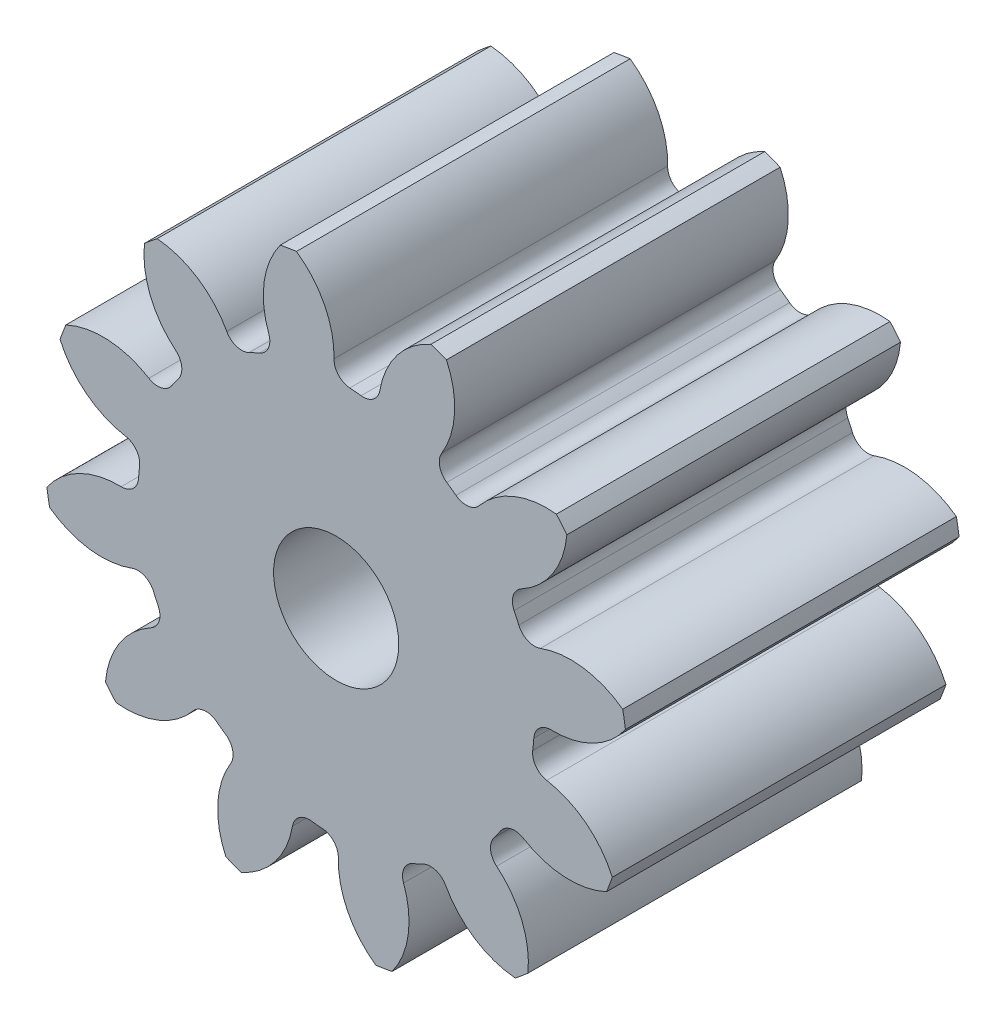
ISO-10303-21;
HEADER;
FILE_DESCRIPTION(('STEP AP214'),'2;1');
FILE_NAME('part.step','',(''),(''),'','','');
FILE_SCHEMA(('AUTOMOTIVE_DESIGN { 1 0 10303 214 1 1 1 1 }'));
ENDSEC;
DATA;
#1=APPLICATION_CONTEXT('core data for automotive mechanical design processes');
#2=APPLICATION_PROTOCOL_DEFINITION('international standard','automotive_design',2000,#1);
#3=PRODUCT_CONTEXT('',#1,'mechanical');
#4=PRODUCT('Part','Part','',(#3));
#5=PRODUCT_RELATED_PRODUCT_CATEGORY('part','',(#4));
#6=PRODUCT_DEFINITION_FORMATION('','',#4);
#7=PRODUCT_DEFINITION_CONTEXT('part definition',#1,'design');
#8=PRODUCT_DEFINITION('design','',#6,#7);
#9=PRODUCT_DEFINITION_SHAPE('','',#8);
#10=(LENGTH_UNIT() NAMED_UNIT(*) SI_UNIT(.MILLI.,.METRE.));
#11=(NAMED_UNIT(*) PLANE_ANGLE_UNIT() SI_UNIT($,.RADIAN.));
#12=(NAMED_UNIT(*) SI_UNIT($,.STERADIAN.) SOLID_ANGLE_UNIT());
#13=UNCERTAINTY_MEASURE_WITH_UNIT(LENGTH_MEASURE(1.E-05),#10,'distance_accuracy_value','');
#14=(GEOMETRIC_REPRESENTATION_CONTEXT(3) GLOBAL_UNCERTAINTY_ASSIGNED_CONTEXT((#13)) GLOBAL_UNIT_ASSIGNED_CONTEXT((#10,
#11,#12)) REPRESENTATION_CONTEXT('',''));
#15=CARTESIAN_POINT('',(0.,0.,0.));
#16=DIRECTION('',(0.,0.,1.));
#17=DIRECTION('',(1.,0.,0.));
#18=AXIS2_PLACEMENT_3D('',#15,#16,#17);
#19=CARTESIAN_POINT('',(0.,0.,101.6));
#20=DIRECTION('',(0.,0.,-1.));
#21=DIRECTION('',(-1.,0.,0.));
#22=AXIS2_PLACEMENT_3D('',#19,#20,#21);
#23=CYLINDRICAL_SURFACE('',#22,88.9);
#24=DIRECTION('',(0.,0.,-1.));
#25=VECTOR('',#24,1.);
#26=CARTESIAN_POINT('',(87.2539698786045,17.0280574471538,50.8));
#27=LINE('',#26,#25);
#28=CARTESIAN_POINT('',(87.2539698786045,17.0280574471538,101.6));
#29=VERTEX_POINT('',#28);
#30=CARTESIAN_POINT('',(87.2539698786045,17.0280574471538,0.));
#31=VERTEX_POINT('',#30);
#32=EDGE_CURVE('E528',#29,#31,#27,.T.);
#33=ORIENTED_EDGE('',*,*,#32,.F.);
#34=CARTESIAN_POINT('',(0.,0.,101.6));
#35=DIRECTION('',(0.,0.,1.));
#36=DIRECTION('',(1.,0.,0.));
#37=AXIS2_PLACEMENT_3D('',#34,#35,#36);
#38=CIRCLE('',#37,88.9);
#39=CARTESIAN_POINT('',(88.0758497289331,12.0770316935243,101.6));
#40=VERTEX_POINT('',#39);
#41=EDGE_CURVE('E945',#40,#29,#38,.T.);
#42=ORIENTED_EDGE('',*,*,#41,.F.);
#43=DIRECTION('',(0.,0.,-1.));
#44=VECTOR('',#43,1.);
#45=CARTESIAN_POINT('',(88.0758497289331,12.0770316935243,50.8));
#46=LINE('',#45,#44);
#47=CARTESIAN_POINT('',(88.0758497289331,12.0770316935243,0.));
#48=VERTEX_POINT('',#47);
#49=EDGE_CURVE('E939',#48,#40,#46,.F.);
#50=ORIENTED_EDGE('',*,*,#49,.F.);
#51=CARTESIAN_POINT('',(0.,0.,0.));
#52=DIRECTION('',(0.,0.,1.));
#53=DIRECTION('',(1.,0.,0.));
#54=AXIS2_PLACEMENT_3D('',#51,#52,#53);
#55=CIRCLE('',#54,88.9);
#56=EDGE_CURVE('E950',#48,#31,#55,.T.);
#57=ORIENTED_EDGE('',*,*,#56,.T.);
#58=EDGE_LOOP('',(#33,#42,#50,#57));
#59=FACE_BOUND('',#58,.T.);
#60=ADVANCED_FACE('F33',(#59),#23,.T.);
#61=DIRECTION('',(0.,0.,-1.));
#62=VECTOR('',#61,1.);
#63=CARTESIAN_POINT('',(70.2374074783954,54.4969411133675,50.8));
#64=LINE('',#63,#62);
#65=CARTESIAN_POINT('',(70.2374074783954,54.4969411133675,0.));
#66=VERTEX_POINT('',#65);
#67=CARTESIAN_POINT('',(70.2374074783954,54.4969411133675,101.6));
#68=VERTEX_POINT('',#67);
#69=EDGE_CURVE('E499',#66,#68,#64,.F.);
#70=ORIENTED_EDGE('',*,*,#69,.F.);
#71=CARTESIAN_POINT('',(67.0501257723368,58.3737152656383,0.));
#72=VERTEX_POINT('',#71);
#73=EDGE_CURVE('E953',#66,#72,#55,.T.);
#74=ORIENTED_EDGE('',*,*,#73,.T.);
#75=DIRECTION('',(0.,0.,-1.));
#76=VECTOR('',#75,1.);
#77=CARTESIAN_POINT('',(67.0501257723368,58.3737152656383,50.8));
#78=LINE('',#77,#76);
#79=CARTESIAN_POINT('',(67.0501257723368,58.3737152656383,101.6));
#80=VERTEX_POINT('',#79);
#81=EDGE_CURVE('E561',#80,#72,#78,.T.);
#82=ORIENTED_EDGE('',*,*,#81,.F.);
#83=EDGE_CURVE('E948',#68,#80,#38,.T.);
#84=ORIENTED_EDGE('',*,*,#83,.F.);
#85=EDGE_LOOP('',(#70,#74,#82,#84));
#86=FACE_BOUND('',#85,.T.);
#87=ADVANCED_FACE('F1091',(#86),#23,.T.);
#88=CARTESIAN_POINT('',(0.,0.,101.6));
#89=DIRECTION('',(0.,0.,1.));
#90=DIRECTION('',(1.,0.,0.));
#91=AXIS2_PLACEMENT_3D('',#88,#89,#90);
#92=PLANE('',#91);
#93=CARTESIAN_POINT('',(0.,0.,101.599999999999));
#94=DIRECTION('',(0.,0.,1.));
#95=DIRECTION('',(1.,0.,0.));
#96=AXIS2_PLACEMENT_3D('',#93,#94,#95);
#97=CIRCLE('',#96,19.05);
#98=CARTESIAN_POINT('',(19.05,0.,101.599999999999));
#99=VERTEX_POINT('',#98);
#100=EDGE_CURVE('E516',#99,#99,#97,.T.);
#101=ORIENTED_EDGE('',*,*,#100,.F.);
#102=EDGE_LOOP('',(#101));
#103=FACE_BOUND('',#102,.T.);
#104=ORIENTED_EDGE('',*,*,#41,.T.);
#105=CARTESIAN_POINT('',(71.4593732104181,-4.55779864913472,101.6));
#106=DIRECTION('',(0.,0.,-1.));
#107=DIRECTION('',(0.866025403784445,0.499999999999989,0.));
#108=AXIS2_PLACEMENT_3D('',#105,#106,#107);
#109=CIRCLE('',#108,26.7473076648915);
#110=CARTESIAN_POINT('',(62.1736338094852,20.525931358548,101.6));
#111=VERTEX_POINT('',#110);
#112=EDGE_CURVE('E508',#111,#29,#109,.T.);
#113=ORIENTED_EDGE('',*,*,#112,.F.);
#114=CARTESIAN_POINT('',(60.379170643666,25.3733460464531,101.6));
#115=DIRECTION('',(0.,0.,1.));
#116=DIRECTION('',(-0.866025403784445,-0.499999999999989,0.));
#117=AXIS2_PLACEMENT_3D('',#114,#115,#116);
#118=CIRCLE('',#117,5.1689);
#119=CARTESIAN_POINT('',(55.613934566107,23.3708345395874,101.6));
#120=VERTEX_POINT('',#119);
#121=EDGE_CURVE('E506',#120,#111,#118,.T.);
#122=ORIENTED_EDGE('',*,*,#121,.F.);
#123=CARTESIAN_POINT('',(0.,0.,101.6));
#124=DIRECTION('',(0.,0.,-1.));
#125=DIRECTION('',(0.866025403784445,0.499999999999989,0.));
#126=AXIS2_PLACEMENT_3D('',#123,#124,#125);
#127=CIRCLE('',#126,60.325);
#128=CARTESIAN_POINT('',(54.1935321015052,26.4984283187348,101.6));
#129=VERTEX_POINT('',#128);
#130=EDGE_CURVE('E491',#129,#120,#127,.T.);
#131=ORIENTED_EDGE('',*,*,#130,.F.);
#132=CARTESIAN_POINT('',(58.8370621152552,28.7689252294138,101.6));
#133=DIRECTION('',(0.,0.,1.));
#134=DIRECTION('',(-0.866025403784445,-0.499999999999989,0.));
#135=AXIS2_PLACEMENT_3D('',#132,#133,#134);
#136=CIRCLE('',#135,5.1689);
#137=CARTESIAN_POINT('',(56.3677839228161,33.3098714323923,101.6));
#138=VERTEX_POINT('',#137);
#139=EDGE_CURVE('E483',#138,#129,#136,.T.);
#140=ORIENTED_EDGE('',*,*,#139,.F.);
#141=CARTESIAN_POINT('',(43.5901052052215,56.8077307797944,101.6));
#142=DIRECTION('',(0.,0.,-1.));
#143=DIRECTION('',(-0.866025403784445,-0.499999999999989,0.));
#144=AXIS2_PLACEMENT_3D('',#141,#142,#143);
#145=CIRCLE('',#144,26.7473076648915);
#146=EDGE_CURVE('E513',#68,#138,#145,.T.);
#147=ORIENTED_EDGE('',*,*,#146,.F.);
#148=ORIENTED_EDGE('',*,*,#83,.T.);
#149=CARTESIAN_POINT('',(64.1645318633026,31.7825171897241,101.6));
#150=DIRECTION('',(0.,0.,-1.));
#151=DIRECTION('',(0.50000000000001,0.866025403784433,0.));
#152=AXIS2_PLACEMENT_3D('',#149,#150,#151);
#153=CIRCLE('',#152,26.7473076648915);
#154=CARTESIAN_POINT('',(43.5809806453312,48.8627948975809,101.6));
#155=VERTEX_POINT('',#154);
#156=EDGE_CURVE('E537',#155,#80,#153,.T.);
#157=ORIENTED_EDGE('',*,*,#156,.F.);
#158=CARTESIAN_POINT('',(39.6032226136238,52.1635475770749,101.6));
#159=DIRECTION('',(0.,0.,1.));
#160=DIRECTION('',(-0.50000000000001,-0.866025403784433,0.));
#161=AXIS2_PLACEMENT_3D('',#158,#159,#160);
#162=CIRCLE('',#161,5.1689);
#163=CARTESIAN_POINT('',(36.4776628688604,48.046703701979,101.6));
#164=VERTEX_POINT('',#163);
#165=EDGE_CURVE('E535',#164,#155,#162,.T.);
#166=ORIENTED_EDGE('',*,*,#165,.F.);
#167=CARTESIAN_POINT('',(0.,0.,101.6));
#168=DIRECTION('',(0.,0.,-1.));
#169=DIRECTION('',(0.50000000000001,0.866025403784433,0.));
#170=AXIS2_PLACEMENT_3D('',#167,#168,#169);
#171=CIRCLE('',#170,60.325);
#172=CARTESIAN_POINT('',(33.6837613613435,50.0450781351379,101.6));
#173=VERTEX_POINT('',#172);
#174=EDGE_CURVE('E532',#173,#164,#171,.T.);
#175=ORIENTED_EDGE('',*,*,#174,.F.);
#176=CARTESIAN_POINT('',(36.569927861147,54.333151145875,101.6));
#177=DIRECTION('',(0.,0.,1.));
#178=DIRECTION('',(-0.50000000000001,-0.866025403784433,0.));
#179=AXIS2_PLACEMENT_3D('',#176,#177,#178);
#180=CIRCLE('',#179,5.1689);
#181=CARTESIAN_POINT('',(32.1609971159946,57.0310868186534,101.6));
#182=VERTEX_POINT('',#181);
#183=EDGE_CURVE('E530',#182,#173,#180,.T.);
#184=ORIENTED_EDGE('',*,*,#183,.F.);
#185=CARTESIAN_POINT('',(9.34627307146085,70.9919905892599,101.6));
#186=DIRECTION('',(0.,0.,-1.));
#187=DIRECTION('',(-0.50000000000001,-0.866025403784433,0.));
#188=AXIS2_PLACEMENT_3D('',#185,#186,#187);
#189=CIRCLE('',#188,26.7473076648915);
#190=CARTESIAN_POINT('',(33.5789086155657,82.3144391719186,101.6));
#191=VERTEX_POINT('',#190);
#192=EDGE_CURVE('E540',#191,#182,#189,.T.);
#193=ORIENTED_EDGE('',*,*,#192,.F.);
#194=CARTESIAN_POINT('',(28.8802546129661,84.0781832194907,101.6));
#195=VERTEX_POINT('',#194);
#196=EDGE_CURVE('E985',#191,#195,#38,.T.);
#197=ORIENTED_EDGE('',*,*,#196,.T.);
#198=CARTESIAN_POINT('',(39.676856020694,59.606733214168,101.6));
#199=DIRECTION('',(0.,0.,-1.));
#200=DIRECTION('',(0.,1.,0.));
#201=AXIS2_PLACEMENT_3D('',#198,#199,#200);
#202=CIRCLE('',#201,26.7473076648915);
#203=CARTESIAN_POINT('',(13.3108389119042,64.1069120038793,101.6));
#204=VERTEX_POINT('',#203);
#205=EDGE_CURVE('E572',#204,#195,#202,.T.);
#206=ORIENTED_EDGE('',*,*,#205,.F.);
#207=CARTESIAN_POINT('',(8.21562306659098,64.976568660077,101.6));
#208=DIRECTION('',(0.,0.,1.));
#209=DIRECTION('',(0.,-1.,0.));
#210=AXIS2_PLACEMENT_3D('',#207,#208,#209);
#211=CIRCLE('',#210,5.1689);
#212=CARTESIAN_POINT('',(7.56723086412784,59.8484974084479,101.6));
#213=VERTEX_POINT('',#212);
#214=EDGE_CURVE('E570',#213,#204,#211,.T.);
#215=ORIENTED_EDGE('',*,*,#214,.F.);
#216=CARTESIAN_POINT('',(0.,0.,101.6));
#217=DIRECTION('',(0.,0.,-1.));
#218=DIRECTION('',(0.,1.,0.));
#219=AXIS2_PLACEMENT_3D('',#216,#217,#218);
#220=CIRCLE('',#219,60.325);
#221=CARTESIAN_POINT('',(4.14845396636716,60.1821896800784,101.6));
#222=VERTEX_POINT('',#221);
#223=EDGE_CURVE('E567',#222,#213,#220,.T.);
#224=ORIENTED_EDGE('',*,*,#223,.F.);
#225=CARTESIAN_POINT('',(4.50391096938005,65.3388530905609,101.6));
#226=DIRECTION('',(0.,0.,1.));
#227=DIRECTION('',(0.,-1.,0.));
#228=AXIS2_PLACEMENT_3D('',#225,#226,#227);
#229=CIRCLE('',#228,5.1689);
#230=CARTESIAN_POINT('',(-0.663302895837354,65.470868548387,101.6));
#231=VERTEX_POINT('',#230);
#232=EDGE_CURVE('E565',#231,#222,#229,.T.);
#233=ORIENTED_EDGE('',*,*,#232,.F.);
#234=CARTESIAN_POINT('',(-27.4018853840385,66.1540038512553,101.6));
#235=DIRECTION('',(0.,0.,-1.));
#236=DIRECTION('',(0.,-1.,0.));
#237=AXIS2_PLACEMENT_3D('',#234,#235,#236);
#238=CIRCLE('',#237,26.7473076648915);
#239=CARTESIAN_POINT('',(-12.0770316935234,88.0758497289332,101.6));
#240=VERTEX_POINT('',#239);
#241=EDGE_CURVE('E575',#240,#231,#238,.T.);
#242=ORIENTED_EDGE('',*,*,#241,.F.);
#243=CARTESIAN_POINT('',(-17.0280574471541,87.2539698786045,101.6));
#244=VERTEX_POINT('',#243);
#245=EDGE_CURVE('E1073',#240,#244,#38,.T.);
#246=ORIENTED_EDGE('',*,*,#245,.T.);
#247=CARTESIAN_POINT('',(4.55779864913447,71.4593732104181,101.6));
#248=DIRECTION('',(0.,0.,-1.));
#249=DIRECTION('',(-0.499999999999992,0.866025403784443,0.));
#250=AXIS2_PLACEMENT_3D('',#247,#248,#249);
#251=CIRCLE('',#250,26.7473076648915);
#252=CARTESIAN_POINT('',(-20.5259313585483,62.1736338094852,101.6));
#253=VERTEX_POINT('',#252);
#254=EDGE_CURVE('E610',#253,#244,#251,.T.);
#255=ORIENTED_EDGE('',*,*,#254,.F.);
#256=CARTESIAN_POINT('',(-25.3733460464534,60.3791706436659,101.6));
#257=DIRECTION('',(0.,0.,1.));
#258=DIRECTION('',(0.499999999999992,-0.866025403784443,0.));
#259=AXIS2_PLACEMENT_3D('',#256,#257,#258);
#260=CIRCLE('',#259,5.1689);
#261=CARTESIAN_POINT('',(-23.3708345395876,55.6139345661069,101.6));
#262=VERTEX_POINT('',#261);
#263=EDGE_CURVE('E608',#262,#253,#260,.T.);
#264=ORIENTED_EDGE('',*,*,#263,.F.);
#265=CARTESIAN_POINT('',(0.,0.,101.6));
#266=DIRECTION('',(0.,0.,-1.));
#267=DIRECTION('',(-0.499999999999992,0.866025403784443,0.));
#268=AXIS2_PLACEMENT_3D('',#265,#266,#267);
#269=CIRCLE('',#268,60.325);
#270=CARTESIAN_POINT('',(-26.498428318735,54.1935321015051,101.6));
#271=VERTEX_POINT('',#270);
#272=EDGE_CURVE('E605',#271,#262,#269,.T.);
#273=ORIENTED_EDGE('',*,*,#272,.F.);
#274=CARTESIAN_POINT('',(-28.768925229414,58.8370621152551,101.6));
#275=DIRECTION('',(0.,0.,1.));
#276=DIRECTION('',(0.499999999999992,-0.866025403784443,0.));
#277=AXIS2_PLACEMENT_3D('',#274,#275,#276);
#278=CIRCLE('',#277,5.1689);
#279=CARTESIAN_POINT('',(-33.3098714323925,56.367783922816,101.6));
#280=VERTEX_POINT('',#279);
#281=EDGE_CURVE('E603',#280,#271,#278,.T.);
#282=ORIENTED_EDGE('',*,*,#281,.F.);
#283=CARTESIAN_POINT('',(-56.8077307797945,43.5901052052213,101.6));
#284=DIRECTION('',(0.,0.,-1.));
#285=DIRECTION('',(0.499999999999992,-0.866025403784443,0.));
#286=AXIS2_PLACEMENT_3D('',#283,#284,#285);
#287=CIRCLE('',#286,26.7473076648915);
#288=CARTESIAN_POINT('',(-54.4969411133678,70.2374074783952,101.6));
#289=VERTEX_POINT('',#288);
#290=EDGE_CURVE('E613',#289,#280,#287,.T.);
#291=ORIENTED_EDGE('',*,*,#290,.F.);
#292=CARTESIAN_POINT('',(-58.3737152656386,67.0501257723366,101.6));
#293=VERTEX_POINT('',#292);
#294=EDGE_CURVE('E1069',#289,#293,#38,.T.);
#295=ORIENTED_EDGE('',*,*,#294,.T.);
#296=CARTESIAN_POINT('',(-31.7825171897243,64.1645318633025,101.6));
#297=DIRECTION('',(0.,0.,-1.));
#298=DIRECTION('',(-0.866025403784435,0.500000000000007,0.));
#299=AXIS2_PLACEMENT_3D('',#296,#297,#298);
#300=CIRCLE('',#299,26.7473076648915);
#301=CARTESIAN_POINT('',(-48.8627948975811,43.580980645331,101.6));
#302=VERTEX_POINT('',#301);
#303=EDGE_CURVE('E648',#302,#293,#300,.T.);
#304=ORIENTED_EDGE('',*,*,#303,.F.);
#305=CARTESIAN_POINT('',(-52.1635475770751,39.6032226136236,101.6));
#306=DIRECTION('',(0.,0.,1.));
#307=DIRECTION('',(0.866025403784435,-0.500000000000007,0.));
#308=AXIS2_PLACEMENT_3D('',#305,#306,#307);
#309=CIRCLE('',#308,5.1689);
#310=CARTESIAN_POINT('',(-48.0467037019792,36.4776628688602,101.6));
#311=VERTEX_POINT('',#310);
#312=EDGE_CURVE('E646',#311,#302,#309,.T.);
#313=ORIENTED_EDGE('',*,*,#312,.F.);
#314=CARTESIAN_POINT('',(0.,0.,101.6));
#315=DIRECTION('',(0.,0.,-1.));
#316=DIRECTION('',(-0.866025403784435,0.500000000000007,0.));
#317=AXIS2_PLACEMENT_3D('',#314,#315,#316);
#318=CIRCLE('',#317,60.325);
#319=CARTESIAN_POINT('',(-50.0450781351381,33.6837613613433,101.6));
#320=VERTEX_POINT('',#319);
#321=EDGE_CURVE('E643',#320,#311,#318,.T.);
#322=ORIENTED_EDGE('',*,*,#321,.F.);
#323=CARTESIAN_POINT('',(-54.3331511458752,36.5699278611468,101.6));
#324=DIRECTION('',(0.,0.,1.));
#325=DIRECTION('',(0.866025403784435,-0.500000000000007,0.));
#326=AXIS2_PLACEMENT_3D('',#323,#324,#325);
#327=CIRCLE('',#326,5.1689);
#328=CARTESIAN_POINT('',(-57.0310868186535,32.1609971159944,101.6));
#329=VERTEX_POINT('',#328);
#330=EDGE_CURVE('E641',#329,#320,#327,.T.);
#331=ORIENTED_EDGE('',*,*,#330,.F.);
#332=CARTESIAN_POINT('',(-70.9919905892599,9.3462730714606,101.6));
#333=DIRECTION('',(0.,0.,-1.));
#334=DIRECTION('',(0.866025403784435,-0.500000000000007,0.));
#335=AXIS2_PLACEMENT_3D('',#332,#333,#334);
#336=CIRCLE('',#335,26.7473076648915);
#337=CARTESIAN_POINT('',(-82.3144391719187,33.5789086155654,101.6));
#338=VERTEX_POINT('',#337);
#339=EDGE_CURVE('E651',#338,#329,#336,.T.);
#340=ORIENTED_EDGE('',*,*,#339,.F.);
#341=CARTESIAN_POINT('',(-84.0781832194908,28.8802546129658,101.6));
#342=VERTEX_POINT('',#341);
#343=EDGE_CURVE('E1065',#338,#342,#38,.T.);
#344=ORIENTED_EDGE('',*,*,#343,.T.);
#345=CARTESIAN_POINT('',(-59.6067332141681,39.6768560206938,101.6));
#346=DIRECTION('',(0.,0.,-1.));
#347=DIRECTION('',(-1.,0.,0.));
#348=AXIS2_PLACEMENT_3D('',#345,#346,#347);
#349=CIRCLE('',#348,26.7473076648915);
#350=CARTESIAN_POINT('',(-64.1069120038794,13.310838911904,101.6));
#351=VERTEX_POINT('',#350);
#352=EDGE_CURVE('E686',#351,#342,#349,.T.);
#353=ORIENTED_EDGE('',*,*,#352,.F.);
#354=CARTESIAN_POINT('',(-64.976568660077,8.21562306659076,101.6));
#355=DIRECTION('',(0.,0.,1.));
#356=DIRECTION('',(1.,0.,0.));
#357=AXIS2_PLACEMENT_3D('',#354,#355,#356);
#358=CIRCLE('',#357,5.1689);
#359=CARTESIAN_POINT('',(-59.8484974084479,7.56723086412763,101.6));
#360=VERTEX_POINT('',#359);
#361=EDGE_CURVE('E684',#360,#351,#358,.T.);
#362=ORIENTED_EDGE('',*,*,#361,.F.);
#363=CARTESIAN_POINT('',(0.,0.,101.6));
#364=DIRECTION('',(0.,0.,-1.));
#365=DIRECTION('',(-1.,0.,0.));
#366=AXIS2_PLACEMENT_3D('',#363,#364,#365);
#367=CIRCLE('',#366,60.325);
#368=CARTESIAN_POINT('',(-60.1821896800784,4.14845396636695,101.6));
#369=VERTEX_POINT('',#368);
#370=EDGE_CURVE('E681',#369,#360,#367,.T.);
#371=ORIENTED_EDGE('',*,*,#370,.F.);
#372=CARTESIAN_POINT('',(-65.3388530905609,4.50391096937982,101.6));
#373=DIRECTION('',(0.,0.,1.));
#374=DIRECTION('',(1.,0.,0.));
#375=AXIS2_PLACEMENT_3D('',#372,#373,#374);
#376=CIRCLE('',#375,5.1689);
#377=CARTESIAN_POINT('',(-65.4708685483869,-0.663302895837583,101.6));
#378=VERTEX_POINT('',#377);
#379=EDGE_CURVE('E679',#378,#369,#376,.T.);
#380=ORIENTED_EDGE('',*,*,#379,.F.);
#381=CARTESIAN_POINT('',(-66.1540038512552,-27.4018853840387,101.6));
#382=DIRECTION('',(0.,0.,-1.));
#383=DIRECTION('',(1.,0.,0.));
#384=AXIS2_PLACEMENT_3D('',#381,#382,#383);
#385=CIRCLE('',#384,26.7473076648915);
#386=CARTESIAN_POINT('',(-88.0758497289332,-12.0770316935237,101.6));
#387=VERTEX_POINT('',#386);
#388=EDGE_CURVE('E689',#387,#378,#385,.T.);
#389=ORIENTED_EDGE('',*,*,#388,.F.);
#390=CARTESIAN_POINT('',(-87.2539698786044,-17.0280574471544,101.6));
#391=VERTEX_POINT('',#390);
#392=EDGE_CURVE('E1061',#387,#391,#38,.T.);
#393=ORIENTED_EDGE('',*,*,#392,.T.);
#394=CARTESIAN_POINT('',(-71.4593732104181,4.55779864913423,101.6));
#395=DIRECTION('',(0.,0.,-1.));
#396=DIRECTION('',(-0.866025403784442,-0.499999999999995,0.));
#397=AXIS2_PLACEMENT_3D('',#394,#395,#396);
#398=CIRCLE('',#397,26.7473076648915);
#399=CARTESIAN_POINT('',(-62.1736338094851,-20.5259313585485,101.6));
#400=VERTEX_POINT('',#399);
#401=EDGE_CURVE('E724',#400,#391,#398,.T.);
#402=ORIENTED_EDGE('',*,*,#401,.F.);
#403=CARTESIAN_POINT('',(-60.3791706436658,-25.3733460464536,101.6));
#404=DIRECTION('',(0.,0.,1.));
#405=DIRECTION('',(0.866025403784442,0.499999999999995,0.));
#406=AXIS2_PLACEMENT_3D('',#403,#404,#405);
#407=CIRCLE('',#406,5.1689);
#408=CARTESIAN_POINT('',(-55.6139345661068,-23.3708345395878,101.6));
#409=VERTEX_POINT('',#408);
#410=EDGE_CURVE('E722',#409,#400,#407,.T.);
#411=ORIENTED_EDGE('',*,*,#410,.F.);
#412=CARTESIAN_POINT('',(0.,0.,101.6));
#413=DIRECTION('',(0.,0.,-1.));
#414=DIRECTION('',(-0.866025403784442,-0.499999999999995,0.));
#415=AXIS2_PLACEMENT_3D('',#412,#413,#414);
#416=CIRCLE('',#415,60.325);
#417=CARTESIAN_POINT('',(-54.193532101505,-26.4984283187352,101.6));
#418=VERTEX_POINT('',#417);
#419=EDGE_CURVE('E719',#418,#409,#416,.T.);
#420=ORIENTED_EDGE('',*,*,#419,.F.);
#421=CARTESIAN_POINT('',(-58.837062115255,-28.7689252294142,101.6));
#422=DIRECTION('',(0.,0.,1.));
#423=DIRECTION('',(0.866025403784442,0.499999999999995,0.));
#424=AXIS2_PLACEMENT_3D('',#421,#422,#423);
#425=CIRCLE('',#424,5.1689);
#426=CARTESIAN_POINT('',(-56.3677839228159,-33.3098714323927,101.6));
#427=VERTEX_POINT('',#426);
#428=EDGE_CURVE('E717',#427,#418,#425,.T.);
#429=ORIENTED_EDGE('',*,*,#428,.F.);
#430=CARTESIAN_POINT('',(-43.5901052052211,-56.8077307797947,101.6));
#431=DIRECTION('',(0.,0.,-1.));
#432=DIRECTION('',(0.866025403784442,0.499999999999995,0.));
#433=AXIS2_PLACEMENT_3D('',#430,#431,#432);
#434=CIRCLE('',#433,26.7473076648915);
#435=CARTESIAN_POINT('',(-70.237407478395,-54.496941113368,101.6));
#436=VERTEX_POINT('',#435);
#437=EDGE_CURVE('E727',#436,#427,#434,.T.);
#438=ORIENTED_EDGE('',*,*,#437,.F.);
#439=CARTESIAN_POINT('',(-67.0501257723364,-58.3737152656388,101.6));
#440=VERTEX_POINT('',#439);
#441=EDGE_CURVE('E1057',#436,#440,#38,.T.);
#442=ORIENTED_EDGE('',*,*,#441,.T.);
#443=CARTESIAN_POINT('',(-64.1645318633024,-31.7825171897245,101.6));
#444=DIRECTION('',(0.,0.,-1.));
#445=DIRECTION('',(-0.500000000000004,-0.866025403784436,0.));
#446=AXIS2_PLACEMENT_3D('',#443,#444,#445);
#447=CIRCLE('',#446,26.7473076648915);
#448=CARTESIAN_POINT('',(-43.5809806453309,-48.8627948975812,101.6));
#449=VERTEX_POINT('',#448);
#450=EDGE_CURVE('E762',#449,#440,#447,.T.);
#451=ORIENTED_EDGE('',*,*,#450,.F.);
#452=CARTESIAN_POINT('',(-39.6032226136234,-52.1635475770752,101.6));
#453=DIRECTION('',(0.,0.,1.));
#454=DIRECTION('',(0.500000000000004,0.866025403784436,0.));
#455=AXIS2_PLACEMENT_3D('',#452,#453,#454);
#456=CIRCLE('',#455,5.1689);
#457=CARTESIAN_POINT('',(-36.47766286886,-48.0467037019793,101.6));
#458=VERTEX_POINT('',#457);
#459=EDGE_CURVE('E760',#458,#449,#456,.T.);
#460=ORIENTED_EDGE('',*,*,#459,.F.);
#461=CARTESIAN_POINT('',(0.,0.,101.6));
#462=DIRECTION('',(0.,0.,-1.));
#463=DIRECTION('',(-0.500000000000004,-0.866025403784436,0.));
#464=AXIS2_PLACEMENT_3D('',#461,#462,#463);
#465=CIRCLE('',#464,60.325);
#466=CARTESIAN_POINT('',(-33.6837613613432,-50.0450781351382,101.6));
#467=VERTEX_POINT('',#466);
#468=EDGE_CURVE('E757',#467,#458,#465,.T.);
#469=ORIENTED_EDGE('',*,*,#468,.F.);
#470=CARTESIAN_POINT('',(-36.5699278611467,-54.3331511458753,101.6));
#471=DIRECTION('',(0.,0.,1.));
#472=DIRECTION('',(0.500000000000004,0.866025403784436,0.));
#473=AXIS2_PLACEMENT_3D('',#470,#471,#472);
#474=CIRCLE('',#473,5.1689);
#475=CARTESIAN_POINT('',(-32.1609971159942,-57.0310868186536,101.6));
#476=VERTEX_POINT('',#475);
#477=EDGE_CURVE('E755',#476,#467,#474,.T.);
#478=ORIENTED_EDGE('',*,*,#477,.F.);
#479=CARTESIAN_POINT('',(-9.34627307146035,-70.99199058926,101.6));
#480=DIRECTION('',(0.,0.,-1.));
#481=DIRECTION('',(0.500000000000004,0.866025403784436,0.));
#482=AXIS2_PLACEMENT_3D('',#479,#480,#481);
#483=CIRCLE('',#482,26.7473076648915);
#484=CARTESIAN_POINT('',(-33.5789086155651,-82.3144391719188,101.6));
#485=VERTEX_POINT('',#484);
#486=EDGE_CURVE('E765',#485,#476,#483,.T.);
#487=ORIENTED_EDGE('',*,*,#486,.F.);
#488=CARTESIAN_POINT('',(-28.8802546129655,-84.0781832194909,101.6));
#489=VERTEX_POINT('',#488);
#490=EDGE_CURVE('E1053',#485,#489,#38,.T.);
#491=ORIENTED_EDGE('',*,*,#490,.T.);
#492=CARTESIAN_POINT('',(-39.6768560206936,-59.6067332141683,101.6));
#493=DIRECTION('',(0.,0.,-1.));
#494=DIRECTION('',(0.,-1.,0.));
#495=AXIS2_PLACEMENT_3D('',#492,#493,#494);
#496=CIRCLE('',#495,26.7473076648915);
#497=CARTESIAN_POINT('',(-13.3108389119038,-64.1069120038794,101.6));
#498=VERTEX_POINT('',#497);
#499=EDGE_CURVE('E800',#498,#489,#496,.T.);
#500=ORIENTED_EDGE('',*,*,#499,.F.);
#501=CARTESIAN_POINT('',(-8.21562306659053,-64.976568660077,101.6));
#502=DIRECTION('',(0.,0.,1.));
#503=DIRECTION('',(0.,1.,0.));
#504=AXIS2_PLACEMENT_3D('',#501,#502,#503);
#505=CIRCLE('',#504,5.1689);
#506=CARTESIAN_POINT('',(-7.56723086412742,-59.8484974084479,101.6));
#507=VERTEX_POINT('',#506);
#508=EDGE_CURVE('E798',#507,#498,#505,.T.);
#509=ORIENTED_EDGE('',*,*,#508,.F.);
#510=CARTESIAN_POINT('',(0.,0.,101.6));
#511=DIRECTION('',(0.,0.,-1.));
#512=DIRECTION('',(0.,-1.,0.));
#513=AXIS2_PLACEMENT_3D('',#510,#511,#512);
#514=CIRCLE('',#513,60.325);
#515=CARTESIAN_POINT('',(-4.14845396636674,-60.1821896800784,101.6));
#516=VERTEX_POINT('',#515);
#517=EDGE_CURVE('E795',#516,#507,#514,.T.);
#518=ORIENTED_EDGE('',*,*,#517,.F.);
#519=CARTESIAN_POINT('',(-4.50391096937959,-65.3388530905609,101.6));
#520=DIRECTION('',(0.,0.,1.));
#521=DIRECTION('',(0.,1.,0.));
#522=AXIS2_PLACEMENT_3D('',#519,#520,#521);
#523=CIRCLE('',#522,5.1689);
#524=CARTESIAN_POINT('',(0.663302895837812,-65.4708685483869,101.6));
#525=VERTEX_POINT('',#524);
#526=EDGE_CURVE('E793',#525,#516,#523,.T.);
#527=ORIENTED_EDGE('',*,*,#526,.F.);
#528=CARTESIAN_POINT('',(27.401885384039,-66.1540038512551,101.6));
#529=DIRECTION('',(0.,0.,-1.));
#530=DIRECTION('',(0.,1.,0.));
#531=AXIS2_PLACEMENT_3D('',#528,#529,#530);
#532=CIRCLE('',#531,26.7473076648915);
#533=CARTESIAN_POINT('',(12.077031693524,-88.0758497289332,101.6));
#534=VERTEX_POINT('',#533);
#535=EDGE_CURVE('E803',#534,#525,#532,.T.);
#536=ORIENTED_EDGE('',*,*,#535,.F.);
#537=CARTESIAN_POINT('',(17.0280574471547,-87.2539698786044,101.6));
#538=VERTEX_POINT('',#537);
#539=EDGE_CURVE('E1049',#534,#538,#38,.T.);
#540=ORIENTED_EDGE('',*,*,#539,.T.);
#541=CARTESIAN_POINT('',(-4.55779864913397,-71.4593732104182,101.6));
#542=DIRECTION('',(0.,0.,-1.));
#543=DIRECTION('',(0.499999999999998,-0.86602540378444,0.));
#544=AXIS2_PLACEMENT_3D('',#541,#542,#543);
#545=CIRCLE('',#544,26.7473076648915);
#546=CARTESIAN_POINT('',(20.5259313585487,-62.173633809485,101.6));
#547=VERTEX_POINT('',#546);
#548=EDGE_CURVE('E838',#547,#538,#545,.T.);
#549=ORIENTED_EDGE('',*,*,#548,.F.);
#550=CARTESIAN_POINT('',(25.3733460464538,-60.3791706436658,101.6));
#551=DIRECTION('',(0.,0.,1.));
#552=DIRECTION('',(-0.499999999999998,0.86602540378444,0.));
#553=AXIS2_PLACEMENT_3D('',#550,#551,#552);
#554=CIRCLE('',#553,5.1689);
#555=CARTESIAN_POINT('',(23.370834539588,-55.6139345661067,101.6));
#556=VERTEX_POINT('',#555);
#557=EDGE_CURVE('E836',#556,#547,#554,.T.);
#558=ORIENTED_EDGE('',*,*,#557,.F.);
#559=CARTESIAN_POINT('',(0.,0.,101.6));
#560=DIRECTION('',(0.,0.,-1.));
#561=DIRECTION('',(0.499999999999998,-0.86602540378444,0.));
#562=AXIS2_PLACEMENT_3D('',#559,#560,#561);
#563=CIRCLE('',#562,60.325);
#564=CARTESIAN_POINT('',(26.4984283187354,-54.1935321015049,101.6));
#565=VERTEX_POINT('',#564);
#566=EDGE_CURVE('E833',#565,#556,#563,.T.);
#567=ORIENTED_EDGE('',*,*,#566,.F.);
#568=CARTESIAN_POINT('',(28.7689252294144,-58.8370621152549,101.6));
#569=DIRECTION('',(0.,0.,1.));
#570=DIRECTION('',(-0.499999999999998,0.86602540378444,0.));
#571=AXIS2_PLACEMENT_3D('',#568,#569,#570);
#572=CIRCLE('',#571,5.1689);
#573=CARTESIAN_POINT('',(33.3098714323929,-56.3677839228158,101.6));
#574=VERTEX_POINT('',#573);
#575=EDGE_CURVE('E831',#574,#565,#572,.T.);
#576=ORIENTED_EDGE('',*,*,#575,.F.);
#577=CARTESIAN_POINT('',(56.8077307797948,-43.5901052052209,101.6));
#578=DIRECTION('',(0.,0.,-1.));
#579=DIRECTION('',(-0.499999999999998,0.86602540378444,0.));
#580=AXIS2_PLACEMENT_3D('',#577,#578,#579);
#581=CIRCLE('',#580,26.7473076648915);
#582=CARTESIAN_POINT('',(54.4969411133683,-70.2374074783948,101.6));
#583=VERTEX_POINT('',#582);
#584=EDGE_CURVE('E841',#583,#574,#581,.T.);
#585=ORIENTED_EDGE('',*,*,#584,.F.);
#586=CARTESIAN_POINT('',(58.373715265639,-67.0501257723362,101.6));
#587=VERTEX_POINT('',#586);
#588=EDGE_CURVE('E1048',#583,#587,#38,.T.);
#589=ORIENTED_EDGE('',*,*,#588,.T.);
#590=CARTESIAN_POINT('',(31.7825171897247,-64.1645318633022,101.6));
#591=DIRECTION('',(0.,0.,-1.));
#592=DIRECTION('',(0.866025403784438,-0.500000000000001,0.));
#593=AXIS2_PLACEMENT_3D('',#590,#591,#592);
#594=CIRCLE('',#593,26.7473076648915);
#595=CARTESIAN_POINT('',(48.8627948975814,-43.5809806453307,101.6));
#596=VERTEX_POINT('',#595);
#597=EDGE_CURVE('E876',#596,#587,#594,.T.);
#598=ORIENTED_EDGE('',*,*,#597,.F.);
#599=CARTESIAN_POINT('',(52.1635475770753,-39.6032226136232,101.6));
#600=DIRECTION('',(0.,0.,1.));
#601=DIRECTION('',(-0.866025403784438,0.500000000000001,0.));
#602=AXIS2_PLACEMENT_3D('',#599,#600,#601);
#603=CIRCLE('',#602,5.1689);
#604=CARTESIAN_POINT('',(48.0467037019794,-36.4776628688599,101.6));
#605=VERTEX_POINT('',#604);
#606=EDGE_CURVE('E874',#605,#596,#603,.T.);
#607=ORIENTED_EDGE('',*,*,#606,.F.);
#608=CARTESIAN_POINT('',(0.,0.,101.6));
#609=DIRECTION('',(0.,0.,-1.));
#610=DIRECTION('',(0.866025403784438,-0.500000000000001,0.));
#611=AXIS2_PLACEMENT_3D('',#608,#609,#610);
#612=CIRCLE('',#611,60.325);
#613=CARTESIAN_POINT('',(50.0450781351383,-33.683761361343,101.6));
#614=VERTEX_POINT('',#613);
#615=EDGE_CURVE('E871',#614,#605,#612,.T.);
#616=ORIENTED_EDGE('',*,*,#615,.F.);
#617=CARTESIAN_POINT('',(54.3331511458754,-36.5699278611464,101.6));
#618=DIRECTION('',(0.,0.,1.));
#619=DIRECTION('',(-0.866025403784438,0.500000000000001,0.));
#620=AXIS2_PLACEMENT_3D('',#617,#618,#619);
#621=CIRCLE('',#620,5.1689);
#622=CARTESIAN_POINT('',(57.0310868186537,-32.160997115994,101.6));
#623=VERTEX_POINT('',#622);
#624=EDGE_CURVE('E869',#623,#614,#621,.T.);
#625=ORIENTED_EDGE('',*,*,#624,.F.);
#626=CARTESIAN_POINT('',(70.99199058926,-9.34627307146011,101.6));
#627=DIRECTION('',(0.,0.,-1.));
#628=DIRECTION('',(-0.866025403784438,0.500000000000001,0.));
#629=AXIS2_PLACEMENT_3D('',#626,#627,#628);
#630=CIRCLE('',#629,26.7473076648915);
#631=CARTESIAN_POINT('',(82.314439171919,-33.5789086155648,101.6));
#632=VERTEX_POINT('',#631);
#633=EDGE_CURVE('E879',#632,#623,#630,.T.);
#634=ORIENTED_EDGE('',*,*,#633,.F.);
#635=CARTESIAN_POINT('',(84.078183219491,-28.8802546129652,101.6));
#636=VERTEX_POINT('',#635);
#637=EDGE_CURVE('E949',#632,#636,#38,.T.);
#638=ORIENTED_EDGE('',*,*,#637,.T.);
#639=CARTESIAN_POINT('',(59.6067332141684,-39.6768560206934,101.6));
#640=DIRECTION('',(0.,0.,-1.));
#641=DIRECTION('',(1.,0.,0.));
#642=AXIS2_PLACEMENT_3D('',#639,#640,#641);
#643=CIRCLE('',#642,26.7473076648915);
#644=CARTESIAN_POINT('',(64.1069120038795,-13.3108389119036,101.6));
#645=VERTEX_POINT('',#644);
#646=EDGE_CURVE('E914',#645,#636,#643,.T.);
#647=ORIENTED_EDGE('',*,*,#646,.F.);
#648=CARTESIAN_POINT('',(64.9765686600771,-8.2156230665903,101.6));
#649=DIRECTION('',(0.,0.,1.));
#650=DIRECTION('',(-1.,0.,0.));
#651=AXIS2_PLACEMENT_3D('',#648,#649,#650);
#652=CIRCLE('',#651,5.1689);
#653=CARTESIAN_POINT('',(59.8484974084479,-7.56723086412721,101.6));
#654=VERTEX_POINT('',#653);
#655=EDGE_CURVE('E912',#654,#645,#652,.T.);
#656=ORIENTED_EDGE('',*,*,#655,.F.);
#657=CARTESIAN_POINT('',(0.,0.,101.6));
#658=DIRECTION('',(0.,0.,-1.));
#659=DIRECTION('',(1.,0.,0.));
#660=AXIS2_PLACEMENT_3D('',#657,#658,#659);
#661=CIRCLE('',#660,60.325);
#662=CARTESIAN_POINT('',(60.1821896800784,-4.14845396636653,101.6));
#663=VERTEX_POINT('',#662);
#664=EDGE_CURVE('E909',#663,#654,#661,.T.);
#665=ORIENTED_EDGE('',*,*,#664,.F.);
#666=CARTESIAN_POINT('',(65.3388530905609,-4.50391096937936,101.6));
#667=DIRECTION('',(0.,0.,1.));
#668=DIRECTION('',(-1.,0.,0.));
#669=AXIS2_PLACEMENT_3D('',#666,#667,#668);
#670=CIRCLE('',#669,5.1689);
#671=CARTESIAN_POINT('',(65.4708685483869,0.66330289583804,101.6));
#672=VERTEX_POINT('',#671);
#673=EDGE_CURVE('E907',#672,#663,#670,.T.);
#674=ORIENTED_EDGE('',*,*,#673,.F.);
#675=CARTESIAN_POINT('',(66.154003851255,27.4018853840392,101.6));
#676=DIRECTION('',(0.,0.,-1.));
#677=DIRECTION('',(-1.,0.,0.));
#678=AXIS2_PLACEMENT_3D('',#675,#676,#677);
#679=CIRCLE('',#678,26.7473076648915);
#680=EDGE_CURVE('E917',#40,#672,#679,.T.);
#681=ORIENTED_EDGE('',*,*,#680,.F.);
#682=EDGE_LOOP('',(#104,#113,#122,#131,#140,#147,#148,#157,#166,#175,#184,#193,#197,#206,#215,
#224,#233,#242,#246,#255,#264,#273,#282,#291,#295,#304,#313,#322,#331,#340,#344,#353,#362,#371,
#380,#389,#393,#402,#411,#420,#429,#438,#442,#451,#460,#469,#478,#487,#491,#500,#509,#518,#527,
#536,#540,#549,#558,#567,#576,#585,#589,#598,#607,#616,#625,#634,#638,#647,#656,#665,#674,#681));
#683=FACE_BOUND('',#682,.T.);
#684=ADVANCED_FACE('F504',(#103,#683),#92,.T.);
#685=CARTESIAN_POINT('',(0.,0.,0.));
#686=DIRECTION('',(0.,0.,1.));
#687=DIRECTION('',(1.,0.,0.));
#688=AXIS2_PLACEMENT_3D('',#685,#686,#687);
#689=PLANE('',#688);
#690=CARTESIAN_POINT('',(0.,0.,0.));
#691=DIRECTION('',(0.,0.,1.));
#692=DIRECTION('',(1.,0.,0.));
#693=AXIS2_PLACEMENT_3D('',#690,#691,#692);
#694=CIRCLE('',#693,19.05);
#695=CARTESIAN_POINT('',(19.05,0.,-1.77635683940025E-12));
#696=VERTEX_POINT('',#695);
#697=EDGE_CURVE('E36',#696,#696,#694,.T.);
#698=ORIENTED_EDGE('',*,*,#697,.T.);
#699=EDGE_LOOP('',(#698));
#700=FACE_BOUND('',#699,.T.);
#701=CARTESIAN_POINT('',(71.4593732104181,-4.55779864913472,0.));
#702=DIRECTION('',(0.,0.,-1.));
#703=DIRECTION('',(0.866025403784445,0.499999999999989,0.));
#704=AXIS2_PLACEMENT_3D('',#701,#702,#703);
#705=CIRCLE('',#704,26.7473076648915);
#706=CARTESIAN_POINT('',(62.1736338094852,20.525931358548,0.));
#707=VERTEX_POINT('',#706);
#708=EDGE_CURVE('E492',#707,#31,#705,.T.);
#709=ORIENTED_EDGE('',*,*,#708,.T.);
#710=ORIENTED_EDGE('',*,*,#56,.F.);
#711=CARTESIAN_POINT('',(66.154003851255,27.4018853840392,0.));
#712=DIRECTION('',(0.,0.,1.));
#713=DIRECTION('',(1.,0.,0.));
#714=AXIS2_PLACEMENT_3D('',#711,#712,#713);
#715=CIRCLE('',#714,26.7473076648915);
#716=CARTESIAN_POINT('',(65.4708685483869,0.66330289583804,0.));
#717=VERTEX_POINT('',#716);
#718=EDGE_CURVE('E947',#717,#48,#715,.T.);
#719=ORIENTED_EDGE('',*,*,#718,.F.);
#720=CARTESIAN_POINT('',(65.3388530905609,-4.50391096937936,0.));
#721=DIRECTION('',(0.,0.,1.));
#722=DIRECTION('',(-1.,0.,0.));
#723=AXIS2_PLACEMENT_3D('',#720,#721,#722);
#724=CIRCLE('',#723,5.1689);
#725=CARTESIAN_POINT('',(60.1821896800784,-4.14845396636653,0.));
#726=VERTEX_POINT('',#725);
#727=EDGE_CURVE('E906',#717,#726,#724,.T.);
#728=ORIENTED_EDGE('',*,*,#727,.T.);
#729=CARTESIAN_POINT('',(0.,0.,0.));
#730=DIRECTION('',(0.,0.,-1.));
#731=DIRECTION('',(1.,0.,0.));
#732=AXIS2_PLACEMENT_3D('',#729,#730,#731);
#733=CIRCLE('',#732,60.325);
#734=CARTESIAN_POINT('',(59.8484974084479,-7.56723086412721,0.));
#735=VERTEX_POINT('',#734);
#736=EDGE_CURVE('E922',#726,#735,#733,.T.);
#737=ORIENTED_EDGE('',*,*,#736,.T.);
#738=CARTESIAN_POINT('',(64.9765686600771,-8.2156230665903,0.));
#739=DIRECTION('',(0.,0.,1.));
#740=DIRECTION('',(-1.,0.,0.));
#741=AXIS2_PLACEMENT_3D('',#738,#739,#740);
#742=CIRCLE('',#741,5.1689);
#743=CARTESIAN_POINT('',(64.1069120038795,-13.3108389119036,0.));
#744=VERTEX_POINT('',#743);
#745=EDGE_CURVE('E925',#735,#744,#742,.T.);
#746=ORIENTED_EDGE('',*,*,#745,.T.);
#747=CARTESIAN_POINT('',(59.6067332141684,-39.6768560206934,0.));
#748=DIRECTION('',(0.,0.,-1.));
#749=DIRECTION('',(1.,0.,0.));
#750=AXIS2_PLACEMENT_3D('',#747,#748,#749);
#751=CIRCLE('',#750,26.7473076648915);
#752=CARTESIAN_POINT('',(84.078183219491,-28.8802546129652,0.));
#753=VERTEX_POINT('',#752);
#754=EDGE_CURVE('E910',#744,#753,#751,.T.);
#755=ORIENTED_EDGE('',*,*,#754,.T.);
#756=CARTESIAN_POINT('',(82.314439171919,-33.5789086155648,0.));
#757=VERTEX_POINT('',#756);
#758=EDGE_CURVE('E944',#757,#753,#55,.T.);
#759=ORIENTED_EDGE('',*,*,#758,.F.);
#760=CARTESIAN_POINT('',(70.99199058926,-9.34627307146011,0.));
#761=DIRECTION('',(0.,0.,1.));
#762=DIRECTION('',(1.,0.,0.));
#763=AXIS2_PLACEMENT_3D('',#760,#761,#762);
#764=CIRCLE('',#763,26.7473076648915);
#765=CARTESIAN_POINT('',(57.0310868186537,-32.160997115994,0.));
#766=VERTEX_POINT('',#765);
#767=EDGE_CURVE('E955',#766,#757,#764,.T.);
#768=ORIENTED_EDGE('',*,*,#767,.F.);
#769=CARTESIAN_POINT('',(54.3331511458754,-36.5699278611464,0.));
#770=DIRECTION('',(0.,0.,1.));
#771=DIRECTION('',(-0.866025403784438,0.500000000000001,0.));
#772=AXIS2_PLACEMENT_3D('',#769,#770,#771);
#773=CIRCLE('',#772,5.1689);
#774=CARTESIAN_POINT('',(50.0450781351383,-33.683761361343,0.));
#775=VERTEX_POINT('',#774);
#776=EDGE_CURVE('E868',#766,#775,#773,.T.);
#777=ORIENTED_EDGE('',*,*,#776,.T.);
#778=CARTESIAN_POINT('',(0.,0.,0.));
#779=DIRECTION('',(0.,0.,-1.));
#780=DIRECTION('',(0.866025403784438,-0.500000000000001,0.));
#781=AXIS2_PLACEMENT_3D('',#778,#779,#780);
#782=CIRCLE('',#781,60.325);
#783=CARTESIAN_POINT('',(48.0467037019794,-36.4776628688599,0.));
#784=VERTEX_POINT('',#783);
#785=EDGE_CURVE('E884',#775,#784,#782,.T.);
#786=ORIENTED_EDGE('',*,*,#785,.T.);
#787=CARTESIAN_POINT('',(52.1635475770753,-39.6032226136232,0.));
#788=DIRECTION('',(0.,0.,1.));
#789=DIRECTION('',(-0.866025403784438,0.500000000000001,0.));
#790=AXIS2_PLACEMENT_3D('',#787,#788,#789);
#791=CIRCLE('',#790,5.1689);
#792=CARTESIAN_POINT('',(48.8627948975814,-43.5809806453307,0.));
#793=VERTEX_POINT('',#792);
#794=EDGE_CURVE('E887',#784,#793,#791,.T.);
#795=ORIENTED_EDGE('',*,*,#794,.T.);
#796=CARTESIAN_POINT('',(31.7825171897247,-64.1645318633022,0.));
#797=DIRECTION('',(0.,0.,-1.));
#798=DIRECTION('',(0.866025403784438,-0.500000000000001,0.));
#799=AXIS2_PLACEMENT_3D('',#796,#797,#798);
#800=CIRCLE('',#799,26.7473076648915);
#801=CARTESIAN_POINT('',(58.373715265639,-67.0501257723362,0.));
#802=VERTEX_POINT('',#801);
#803=EDGE_CURVE('E872',#793,#802,#800,.T.);
#804=ORIENTED_EDGE('',*,*,#803,.T.);
#805=CARTESIAN_POINT('',(54.4969411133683,-70.2374074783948,0.));
#806=VERTEX_POINT('',#805);
#807=EDGE_CURVE('E1019',#806,#802,#55,.T.);
#808=ORIENTED_EDGE('',*,*,#807,.F.);
#809=CARTESIAN_POINT('',(56.8077307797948,-43.5901052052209,0.));
#810=DIRECTION('',(0.,0.,1.));
#811=DIRECTION('',(1.,0.,0.));
#812=AXIS2_PLACEMENT_3D('',#809,#810,#811);
#813=CIRCLE('',#812,26.7473076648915);
#814=CARTESIAN_POINT('',(33.3098714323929,-56.3677839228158,0.));
#815=VERTEX_POINT('',#814);
#816=EDGE_CURVE('E957',#815,#806,#813,.T.);
#817=ORIENTED_EDGE('',*,*,#816,.F.);
#818=CARTESIAN_POINT('',(28.7689252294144,-58.8370621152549,0.));
#819=DIRECTION('',(0.,0.,1.));
#820=DIRECTION('',(-0.499999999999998,0.86602540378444,0.));
#821=AXIS2_PLACEMENT_3D('',#818,#819,#820);
#822=CIRCLE('',#821,5.1689);
#823=CARTESIAN_POINT('',(26.4984283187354,-54.1935321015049,0.));
#824=VERTEX_POINT('',#823);
#825=EDGE_CURVE('E830',#815,#824,#822,.T.);
#826=ORIENTED_EDGE('',*,*,#825,.T.);
#827=CARTESIAN_POINT('',(0.,0.,0.));
#828=DIRECTION('',(0.,0.,-1.));
#829=DIRECTION('',(0.499999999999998,-0.86602540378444,0.));
#830=AXIS2_PLACEMENT_3D('',#827,#828,#829);
#831=CIRCLE('',#830,60.325);
#832=CARTESIAN_POINT('',(23.370834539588,-55.6139345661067,0.));
#833=VERTEX_POINT('',#832);
#834=EDGE_CURVE('E846',#824,#833,#831,.T.);
#835=ORIENTED_EDGE('',*,*,#834,.T.);
#836=CARTESIAN_POINT('',(25.3733460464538,-60.3791706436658,0.));
#837=DIRECTION('',(0.,0.,1.));
#838=DIRECTION('',(-0.499999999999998,0.86602540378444,0.));
#839=AXIS2_PLACEMENT_3D('',#836,#837,#838);
#840=CIRCLE('',#839,5.1689);
#841=CARTESIAN_POINT('',(20.5259313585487,-62.173633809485,0.));
#842=VERTEX_POINT('',#841);
#843=EDGE_CURVE('E849',#833,#842,#840,.T.);
#844=ORIENTED_EDGE('',*,*,#843,.T.);
#845=CARTESIAN_POINT('',(-4.55779864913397,-71.4593732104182,0.));
#846=DIRECTION('',(0.,0.,-1.));
#847=DIRECTION('',(0.499999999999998,-0.86602540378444,0.));
#848=AXIS2_PLACEMENT_3D('',#845,#846,#847);
#849=CIRCLE('',#848,26.7473076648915);
#850=CARTESIAN_POINT('',(17.0280574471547,-87.2539698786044,0.));
#851=VERTEX_POINT('',#850);
#852=EDGE_CURVE('E834',#842,#851,#849,.T.);
#853=ORIENTED_EDGE('',*,*,#852,.T.);
#854=CARTESIAN_POINT('',(12.077031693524,-88.0758497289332,0.));
#855=VERTEX_POINT('',#854);
#856=EDGE_CURVE('E1014',#855,#851,#55,.T.);
#857=ORIENTED_EDGE('',*,*,#856,.F.);
#858=CARTESIAN_POINT('',(27.401885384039,-66.1540038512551,0.));
#859=DIRECTION('',(0.,0.,1.));
#860=DIRECTION('',(1.,0.,0.));
#861=AXIS2_PLACEMENT_3D('',#858,#859,#860);
#862=CIRCLE('',#861,26.7473076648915);
#863=CARTESIAN_POINT('',(0.663302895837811,-65.4708685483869,0.));
#864=VERTEX_POINT('',#863);
#865=EDGE_CURVE('E959',#864,#855,#862,.T.);
#866=ORIENTED_EDGE('',*,*,#865,.F.);
#867=CARTESIAN_POINT('',(-4.50391096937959,-65.3388530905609,0.));
#868=DIRECTION('',(0.,0.,1.));
#869=DIRECTION('',(0.,1.,0.));
#870=AXIS2_PLACEMENT_3D('',#867,#868,#869);
#871=CIRCLE('',#870,5.1689);
#872=CARTESIAN_POINT('',(-4.14845396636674,-60.1821896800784,0.));
#873=VERTEX_POINT('',#872);
#874=EDGE_CURVE('E792',#864,#873,#871,.T.);
#875=ORIENTED_EDGE('',*,*,#874,.T.);
#876=CARTESIAN_POINT('',(0.,0.,0.));
#877=DIRECTION('',(0.,0.,-1.));
#878=DIRECTION('',(0.,-1.,0.));
#879=AXIS2_PLACEMENT_3D('',#876,#877,#878);
#880=CIRCLE('',#879,60.325);
#881=CARTESIAN_POINT('',(-7.56723086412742,-59.8484974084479,0.));
#882=VERTEX_POINT('',#881);
#883=EDGE_CURVE('E808',#873,#882,#880,.T.);
#884=ORIENTED_EDGE('',*,*,#883,.T.);
#885=CARTESIAN_POINT('',(-8.21562306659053,-64.976568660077,0.));
#886=DIRECTION('',(0.,0.,1.));
#887=DIRECTION('',(0.,1.,0.));
#888=AXIS2_PLACEMENT_3D('',#885,#886,#887);
#889=CIRCLE('',#888,5.1689);
#890=CARTESIAN_POINT('',(-13.3108389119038,-64.1069120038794,0.));
#891=VERTEX_POINT('',#890);
#892=EDGE_CURVE('E811',#882,#891,#889,.T.);
#893=ORIENTED_EDGE('',*,*,#892,.T.);
#894=CARTESIAN_POINT('',(-39.6768560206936,-59.6067332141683,0.));
#895=DIRECTION('',(0.,0.,-1.));
#896=DIRECTION('',(0.,-1.,0.));
#897=AXIS2_PLACEMENT_3D('',#894,#895,#896);
#898=CIRCLE('',#897,26.7473076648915);
#899=CARTESIAN_POINT('',(-28.8802546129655,-84.0781832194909,0.));
#900=VERTEX_POINT('',#899);
#901=EDGE_CURVE('E796',#891,#900,#898,.T.);
#902=ORIENTED_EDGE('',*,*,#901,.T.);
#903=CARTESIAN_POINT('',(-33.5789086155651,-82.3144391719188,0.));
#904=VERTEX_POINT('',#903);
#905=EDGE_CURVE('E1009',#904,#900,#55,.T.);
#906=ORIENTED_EDGE('',*,*,#905,.F.);
#907=CARTESIAN_POINT('',(-9.34627307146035,-70.99199058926,0.));
#908=DIRECTION('',(0.,0.,1.));
#909=DIRECTION('',(1.,0.,0.));
#910=AXIS2_PLACEMENT_3D('',#907,#908,#909);
#911=CIRCLE('',#910,26.7473076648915);
#912=CARTESIAN_POINT('',(-32.1609971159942,-57.0310868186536,0.));
#913=VERTEX_POINT('',#912);
#914=EDGE_CURVE('E961',#913,#904,#911,.T.);
#915=ORIENTED_EDGE('',*,*,#914,.F.);
#916=CARTESIAN_POINT('',(-36.5699278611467,-54.3331511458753,0.));
#917=DIRECTION('',(0.,0.,1.));
#918=DIRECTION('',(0.500000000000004,0.866025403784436,0.));
#919=AXIS2_PLACEMENT_3D('',#916,#917,#918);
#920=CIRCLE('',#919,5.1689);
#921=CARTESIAN_POINT('',(-33.6837613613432,-50.0450781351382,0.));
#922=VERTEX_POINT('',#921);
#923=EDGE_CURVE('E754',#913,#922,#920,.T.);
#924=ORIENTED_EDGE('',*,*,#923,.T.);
#925=CARTESIAN_POINT('',(0.,0.,0.));
#926=DIRECTION('',(0.,0.,-1.));
#927=DIRECTION('',(-0.500000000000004,-0.866025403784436,0.));
#928=AXIS2_PLACEMENT_3D('',#925,#926,#927);
#929=CIRCLE('',#928,60.325);
#930=CARTESIAN_POINT('',(-36.47766286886,-48.0467037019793,0.));
#931=VERTEX_POINT('',#930);
#932=EDGE_CURVE('E770',#922,#931,#929,.T.);
#933=ORIENTED_EDGE('',*,*,#932,.T.);
#934=CARTESIAN_POINT('',(-39.6032226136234,-52.1635475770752,0.));
#935=DIRECTION('',(0.,0.,1.));
#936=DIRECTION('',(0.500000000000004,0.866025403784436,0.));
#937=AXIS2_PLACEMENT_3D('',#934,#935,#936);
#938=CIRCLE('',#937,5.1689);
#939=CARTESIAN_POINT('',(-43.5809806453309,-48.8627948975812,0.));
#940=VERTEX_POINT('',#939);
#941=EDGE_CURVE('E773',#931,#940,#938,.T.);
#942=ORIENTED_EDGE('',*,*,#941,.T.);
#943=CARTESIAN_POINT('',(-64.1645318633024,-31.7825171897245,0.));
#944=DIRECTION('',(0.,0.,-1.));
#945=DIRECTION('',(-0.500000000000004,-0.866025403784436,0.));
#946=AXIS2_PLACEMENT_3D('',#943,#944,#945);
#947=CIRCLE('',#946,26.7473076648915);
#948=CARTESIAN_POINT('',(-67.0501257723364,-58.3737152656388,0.));
#949=VERTEX_POINT('',#948);
#950=EDGE_CURVE('E758',#940,#949,#947,.T.);
#951=ORIENTED_EDGE('',*,*,#950,.T.);
#952=CARTESIAN_POINT('',(-70.237407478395,-54.496941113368,0.));
#953=VERTEX_POINT('',#952);
#954=EDGE_CURVE('E1004',#953,#949,#55,.T.);
#955=ORIENTED_EDGE('',*,*,#954,.F.);
#956=CARTESIAN_POINT('',(-43.5901052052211,-56.8077307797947,0.));
#957=DIRECTION('',(0.,0.,1.));
#958=DIRECTION('',(1.,0.,0.));
#959=AXIS2_PLACEMENT_3D('',#956,#957,#958);
#960=CIRCLE('',#959,26.7473076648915);
#961=CARTESIAN_POINT('',(-56.3677839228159,-33.3098714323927,0.));
#962=VERTEX_POINT('',#961);
#963=EDGE_CURVE('E963',#962,#953,#960,.T.);
#964=ORIENTED_EDGE('',*,*,#963,.F.);
#965=CARTESIAN_POINT('',(-58.837062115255,-28.7689252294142,0.));
#966=DIRECTION('',(0.,0.,1.));
#967=DIRECTION('',(0.866025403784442,0.499999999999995,0.));
#968=AXIS2_PLACEMENT_3D('',#965,#966,#967);
#969=CIRCLE('',#968,5.1689);
#970=CARTESIAN_POINT('',(-54.193532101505,-26.4984283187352,0.));
#971=VERTEX_POINT('',#970);
#972=EDGE_CURVE('E716',#962,#971,#969,.T.);
#973=ORIENTED_EDGE('',*,*,#972,.T.);
#974=CARTESIAN_POINT('',(0.,0.,0.));
#975=DIRECTION('',(0.,0.,-1.));
#976=DIRECTION('',(-0.866025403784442,-0.499999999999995,0.));
#977=AXIS2_PLACEMENT_3D('',#974,#975,#976);
#978=CIRCLE('',#977,60.325);
#979=CARTESIAN_POINT('',(-55.6139345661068,-23.3708345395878,0.));
#980=VERTEX_POINT('',#979);
#981=EDGE_CURVE('E732',#971,#980,#978,.T.);
#982=ORIENTED_EDGE('',*,*,#981,.T.);
#983=CARTESIAN_POINT('',(-60.3791706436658,-25.3733460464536,0.));
#984=DIRECTION('',(0.,0.,1.));
#985=DIRECTION('',(0.866025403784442,0.499999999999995,0.));
#986=AXIS2_PLACEMENT_3D('',#983,#984,#985);
#987=CIRCLE('',#986,5.1689);
#988=CARTESIAN_POINT('',(-62.1736338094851,-20.5259313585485,0.));
#989=VERTEX_POINT('',#988);
#990=EDGE_CURVE('E735',#980,#989,#987,.T.);
#991=ORIENTED_EDGE('',*,*,#990,.T.);
#992=CARTESIAN_POINT('',(-71.4593732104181,4.55779864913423,0.));
#993=DIRECTION('',(0.,0.,-1.));
#994=DIRECTION('',(-0.866025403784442,-0.499999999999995,0.));
#995=AXIS2_PLACEMENT_3D('',#992,#993,#994);
#996=CIRCLE('',#995,26.7473076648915);
#997=CARTESIAN_POINT('',(-87.2539698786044,-17.0280574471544,0.));
#998=VERTEX_POINT('',#997);
#999=EDGE_CURVE('E720',#989,#998,#996,.T.);
#1000=ORIENTED_EDGE('',*,*,#999,.T.);
#1001=CARTESIAN_POINT('',(-88.0758497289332,-12.0770316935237,0.));
#1002=VERTEX_POINT('',#1001);
#1003=EDGE_CURVE('E999',#1002,#998,#55,.T.);
#1004=ORIENTED_EDGE('',*,*,#1003,.F.);
#1005=CARTESIAN_POINT('',(-66.1540038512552,-27.4018853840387,0.));
#1006=DIRECTION('',(0.,0.,1.));
#1007=DIRECTION('',(1.,0.,0.));
#1008=AXIS2_PLACEMENT_3D('',#1005,#1006,#1007);
#1009=CIRCLE('',#1008,26.7473076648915);
#1010=CARTESIAN_POINT('',(-65.4708685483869,-0.663302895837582,0.));
#1011=VERTEX_POINT('',#1010);
#1012=EDGE_CURVE('E965',#1011,#1002,#1009,.T.);
#1013=ORIENTED_EDGE('',*,*,#1012,.F.);
#1014=CARTESIAN_POINT('',(-65.3388530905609,4.50391096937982,0.));
#1015=DIRECTION('',(0.,0.,1.));
#1016=DIRECTION('',(1.,0.,0.));
#1017=AXIS2_PLACEMENT_3D('',#1014,#1015,#1016);
#1018=CIRCLE('',#1017,5.1689);
#1019=CARTESIAN_POINT('',(-60.1821896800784,4.14845396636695,0.));
#1020=VERTEX_POINT('',#1019);
#1021=EDGE_CURVE('E678',#1011,#1020,#1018,.T.);
#1022=ORIENTED_EDGE('',*,*,#1021,.T.);
#1023=CARTESIAN_POINT('',(0.,0.,0.));
#1024=DIRECTION('',(0.,0.,-1.));
#1025=DIRECTION('',(-1.,0.,0.));
#1026=AXIS2_PLACEMENT_3D('',#1023,#1024,#1025);
#1027=CIRCLE('',#1026,60.325);
#1028=CARTESIAN_POINT('',(-59.8484974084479,7.56723086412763,0.));
#1029=VERTEX_POINT('',#1028);
#1030=EDGE_CURVE('E694',#1020,#1029,#1027,.T.);
#1031=ORIENTED_EDGE('',*,*,#1030,.T.);
#1032=CARTESIAN_POINT('',(-64.976568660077,8.21562306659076,0.));
#1033=DIRECTION('',(0.,0.,1.));
#1034=DIRECTION('',(1.,0.,0.));
#1035=AXIS2_PLACEMENT_3D('',#1032,#1033,#1034);
#1036=CIRCLE('',#1035,5.1689);
#1037=CARTESIAN_POINT('',(-64.1069120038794,13.310838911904,0.));
#1038=VERTEX_POINT('',#1037);
#1039=EDGE_CURVE('E697',#1029,#1038,#1036,.T.);
#1040=ORIENTED_EDGE('',*,*,#1039,.T.);
#1041=CARTESIAN_POINT('',(-59.6067332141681,39.6768560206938,0.));
#1042=DIRECTION('',(0.,0.,-1.));
#1043=DIRECTION('',(-1.,0.,0.));
#1044=AXIS2_PLACEMENT_3D('',#1041,#1042,#1043);
#1045=CIRCLE('',#1044,26.7473076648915);
#1046=CARTESIAN_POINT('',(-84.0781832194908,28.8802546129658,0.));
#1047=VERTEX_POINT('',#1046);
#1048=EDGE_CURVE('E682',#1038,#1047,#1045,.T.);
#1049=ORIENTED_EDGE('',*,*,#1048,.T.);
#1050=CARTESIAN_POINT('',(-82.3144391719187,33.5789086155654,0.));
#1051=VERTEX_POINT('',#1050);
#1052=EDGE_CURVE('E994',#1051,#1047,#55,.T.);
#1053=ORIENTED_EDGE('',*,*,#1052,.F.);
#1054=CARTESIAN_POINT('',(-70.9919905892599,9.3462730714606,0.));
#1055=DIRECTION('',(0.,0.,1.));
#1056=DIRECTION('',(1.,0.,0.));
#1057=AXIS2_PLACEMENT_3D('',#1054,#1055,#1056);
#1058=CIRCLE('',#1057,26.7473076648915);
#1059=CARTESIAN_POINT('',(-57.0310868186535,32.1609971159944,0.));
#1060=VERTEX_POINT('',#1059);
#1061=EDGE_CURVE('E967',#1060,#1051,#1058,.T.);
#1062=ORIENTED_EDGE('',*,*,#1061,.F.);
#1063=CARTESIAN_POINT('',(-54.3331511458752,36.5699278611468,0.));
#1064=DIRECTION('',(0.,0.,1.));
#1065=DIRECTION('',(0.866025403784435,-0.500000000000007,0.));
#1066=AXIS2_PLACEMENT_3D('',#1063,#1064,#1065);
#1067=CIRCLE('',#1066,5.1689);
#1068=CARTESIAN_POINT('',(-50.0450781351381,33.6837613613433,0.));
#1069=VERTEX_POINT('',#1068);
#1070=EDGE_CURVE('E640',#1060,#1069,#1067,.T.);
#1071=ORIENTED_EDGE('',*,*,#1070,.T.);
#1072=CARTESIAN_POINT('',(0.,0.,0.));
#1073=DIRECTION('',(0.,0.,-1.));
#1074=DIRECTION('',(-0.866025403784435,0.500000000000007,0.));
#1075=AXIS2_PLACEMENT_3D('',#1072,#1073,#1074);
#1076=CIRCLE('',#1075,60.325);
#1077=CARTESIAN_POINT('',(-48.0467037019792,36.4776628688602,0.));
#1078=VERTEX_POINT('',#1077);
#1079=EDGE_CURVE('E656',#1069,#1078,#1076,.T.);
#1080=ORIENTED_EDGE('',*,*,#1079,.T.);
#1081=CARTESIAN_POINT('',(-52.1635475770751,39.6032226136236,0.));
#1082=DIRECTION('',(0.,0.,1.));
#1083=DIRECTION('',(0.866025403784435,-0.500000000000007,0.));
#1084=AXIS2_PLACEMENT_3D('',#1081,#1082,#1083);
#1085=CIRCLE('',#1084,5.1689);
#1086=CARTESIAN_POINT('',(-48.8627948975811,43.580980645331,0.));
#1087=VERTEX_POINT('',#1086);
#1088=EDGE_CURVE('E659',#1078,#1087,#1085,.T.);
#1089=ORIENTED_EDGE('',*,*,#1088,.T.);
#1090=CARTESIAN_POINT('',(-31.7825171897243,64.1645318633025,0.));
#1091=DIRECTION('',(0.,0.,-1.));
#1092=DIRECTION('',(-0.866025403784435,0.500000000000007,0.));
#1093=AXIS2_PLACEMENT_3D('',#1090,#1091,#1092);
#1094=CIRCLE('',#1093,26.7473076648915);
#1095=CARTESIAN_POINT('',(-58.3737152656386,67.0501257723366,0.));
#1096=VERTEX_POINT('',#1095);
#1097=EDGE_CURVE('E644',#1087,#1096,#1094,.T.);
#1098=ORIENTED_EDGE('',*,*,#1097,.T.);
#1099=CARTESIAN_POINT('',(-54.4969411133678,70.2374074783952,0.));
#1100=VERTEX_POINT('',#1099);
#1101=EDGE_CURVE('E989',#1100,#1096,#55,.T.);
#1102=ORIENTED_EDGE('',*,*,#1101,.F.);
#1103=CARTESIAN_POINT('',(-56.8077307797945,43.5901052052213,0.));
#1104=DIRECTION('',(0.,0.,1.));
#1105=DIRECTION('',(1.,0.,0.));
#1106=AXIS2_PLACEMENT_3D('',#1103,#1104,#1105);
#1107=CIRCLE('',#1106,26.7473076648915);
#1108=CARTESIAN_POINT('',(-33.3098714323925,56.367783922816,0.));
#1109=VERTEX_POINT('',#1108);
#1110=EDGE_CURVE('E969',#1109,#1100,#1107,.T.);
#1111=ORIENTED_EDGE('',*,*,#1110,.F.);
#1112=CARTESIAN_POINT('',(-28.768925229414,58.8370621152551,0.));
#1113=DIRECTION('',(0.,0.,1.));
#1114=DIRECTION('',(0.499999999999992,-0.866025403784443,0.));
#1115=AXIS2_PLACEMENT_3D('',#1112,#1113,#1114);
#1116=CIRCLE('',#1115,5.1689);
#1117=CARTESIAN_POINT('',(-26.498428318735,54.1935321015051,0.));
#1118=VERTEX_POINT('',#1117);
#1119=EDGE_CURVE('E602',#1109,#1118,#1116,.T.);
#1120=ORIENTED_EDGE('',*,*,#1119,.T.);
#1121=CARTESIAN_POINT('',(0.,0.,0.));
#1122=DIRECTION('',(0.,0.,-1.));
#1123=DIRECTION('',(-0.499999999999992,0.866025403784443,0.));
#1124=AXIS2_PLACEMENT_3D('',#1121,#1122,#1123);
#1125=CIRCLE('',#1124,60.325);
#1126=CARTESIAN_POINT('',(-23.3708345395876,55.6139345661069,0.));
#1127=VERTEX_POINT('',#1126);
#1128=EDGE_CURVE('E618',#1118,#1127,#1125,.T.);
#1129=ORIENTED_EDGE('',*,*,#1128,.T.);
#1130=CARTESIAN_POINT('',(-25.3733460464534,60.3791706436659,0.));
#1131=DIRECTION('',(0.,0.,1.));
#1132=DIRECTION('',(0.499999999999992,-0.866025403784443,0.));
#1133=AXIS2_PLACEMENT_3D('',#1130,#1131,#1132);
#1134=CIRCLE('',#1133,5.1689);
#1135=CARTESIAN_POINT('',(-20.5259313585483,62.1736338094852,0.));
#1136=VERTEX_POINT('',#1135);
#1137=EDGE_CURVE('E621',#1127,#1136,#1134,.T.);
#1138=ORIENTED_EDGE('',*,*,#1137,.T.);
#1139=CARTESIAN_POINT('',(4.55779864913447,71.4593732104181,0.));
#1140=DIRECTION('',(0.,0.,-1.));
#1141=DIRECTION('',(-0.499999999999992,0.866025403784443,0.));
#1142=AXIS2_PLACEMENT_3D('',#1139,#1140,#1141);
#1143=CIRCLE('',#1142,26.7473076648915);
#1144=CARTESIAN_POINT('',(-17.0280574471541,87.2539698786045,0.));
#1145=VERTEX_POINT('',#1144);
#1146=EDGE_CURVE('E606',#1136,#1145,#1143,.T.);
#1147=ORIENTED_EDGE('',*,*,#1146,.T.);
#1148=CARTESIAN_POINT('',(-12.0770316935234,88.0758497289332,0.));
#1149=VERTEX_POINT('',#1148);
#1150=EDGE_CURVE('E988',#1149,#1145,#55,.T.);
#1151=ORIENTED_EDGE('',*,*,#1150,.F.);
#1152=CARTESIAN_POINT('',(-27.4018853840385,66.1540038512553,0.));
#1153=DIRECTION('',(0.,0.,1.));
#1154=DIRECTION('',(1.,0.,0.));
#1155=AXIS2_PLACEMENT_3D('',#1152,#1153,#1154);
#1156=CIRCLE('',#1155,26.7473076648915);
#1157=CARTESIAN_POINT('',(-0.663302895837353,65.470868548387,0.));
#1158=VERTEX_POINT('',#1157);
#1159=EDGE_CURVE('E971',#1158,#1149,#1156,.T.);
#1160=ORIENTED_EDGE('',*,*,#1159,.F.);
#1161=CARTESIAN_POINT('',(4.50391096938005,65.3388530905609,0.));
#1162=DIRECTION('',(0.,0.,1.));
#1163=DIRECTION('',(0.,-1.,0.));
#1164=AXIS2_PLACEMENT_3D('',#1161,#1162,#1163);
#1165=CIRCLE('',#1164,5.1689);
#1166=CARTESIAN_POINT('',(4.14845396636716,60.1821896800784,0.));
#1167=VERTEX_POINT('',#1166);
#1168=EDGE_CURVE('E564',#1158,#1167,#1165,.T.);
#1169=ORIENTED_EDGE('',*,*,#1168,.T.);
#1170=CARTESIAN_POINT('',(0.,0.,0.));
#1171=DIRECTION('',(0.,0.,-1.));
#1172=DIRECTION('',(0.,1.,0.));
#1173=AXIS2_PLACEMENT_3D('',#1170,#1171,#1172);
#1174=CIRCLE('',#1173,60.325);
#1175=CARTESIAN_POINT('',(7.56723086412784,59.8484974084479,0.));
#1176=VERTEX_POINT('',#1175);
#1177=EDGE_CURVE('E580',#1167,#1176,#1174,.T.);
#1178=ORIENTED_EDGE('',*,*,#1177,.T.);
#1179=CARTESIAN_POINT('',(8.21562306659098,64.976568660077,0.));
#1180=DIRECTION('',(0.,0.,1.));
#1181=DIRECTION('',(0.,-1.,0.));
#1182=AXIS2_PLACEMENT_3D('',#1179,#1180,#1181);
#1183=CIRCLE('',#1182,5.1689);
#1184=CARTESIAN_POINT('',(13.3108389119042,64.1069120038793,0.));
#1185=VERTEX_POINT('',#1184);
#1186=EDGE_CURVE('E583',#1176,#1185,#1183,.T.);
#1187=ORIENTED_EDGE('',*,*,#1186,.T.);
#1188=CARTESIAN_POINT('',(39.676856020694,59.606733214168,0.));
#1189=DIRECTION('',(0.,0.,-1.));
#1190=DIRECTION('',(0.,1.,0.));
#1191=AXIS2_PLACEMENT_3D('',#1188,#1189,#1190);
#1192=CIRCLE('',#1191,26.7473076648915);
#1193=CARTESIAN_POINT('',(28.8802546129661,84.0781832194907,0.));
#1194=VERTEX_POINT('',#1193);
#1195=EDGE_CURVE('E568',#1185,#1194,#1192,.T.);
#1196=ORIENTED_EDGE('',*,*,#1195,.T.);
#1197=CARTESIAN_POINT('',(33.5789086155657,82.3144391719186,0.));
#1198=VERTEX_POINT('',#1197);
#1199=EDGE_CURVE('E984',#1198,#1194,#55,.T.);
#1200=ORIENTED_EDGE('',*,*,#1199,.F.);
#1201=CARTESIAN_POINT('',(9.34627307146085,70.9919905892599,0.));
#1202=DIRECTION('',(0.,0.,1.));
#1203=DIRECTION('',(1.,0.,0.));
#1204=AXIS2_PLACEMENT_3D('',#1201,#1202,#1203);
#1205=CIRCLE('',#1204,26.7473076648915);
#1206=CARTESIAN_POINT('',(32.1609971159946,57.0310868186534,0.));
#1207=VERTEX_POINT('',#1206);
#1208=EDGE_CURVE('E41',#1207,#1198,#1205,.T.);
#1209=ORIENTED_EDGE('',*,*,#1208,.F.);
#1210=CARTESIAN_POINT('',(36.569927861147,54.333151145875,0.));
#1211=DIRECTION('',(0.,0.,1.));
#1212=DIRECTION('',(-0.50000000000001,-0.866025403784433,0.));
#1213=AXIS2_PLACEMENT_3D('',#1210,#1211,#1212);
#1214=CIRCLE('',#1213,5.1689);
#1215=CARTESIAN_POINT('',(33.6837613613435,50.0450781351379,0.));
#1216=VERTEX_POINT('',#1215);
#1217=EDGE_CURVE('E56',#1207,#1216,#1214,.T.);
#1218=ORIENTED_EDGE('',*,*,#1217,.T.);
#1219=CARTESIAN_POINT('',(0.,0.,0.));
#1220=DIRECTION('',(0.,0.,-1.));
#1221=DIRECTION('',(0.50000000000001,0.866025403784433,0.));
#1222=AXIS2_PLACEMENT_3D('',#1219,#1220,#1221);
#1223=CIRCLE('',#1222,60.325);
#1224=CARTESIAN_POINT('',(36.4776628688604,48.046703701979,0.));
#1225=VERTEX_POINT('',#1224);
#1226=EDGE_CURVE('E544',#1216,#1225,#1223,.T.);
#1227=ORIENTED_EDGE('',*,*,#1226,.T.);
#1228=CARTESIAN_POINT('',(39.6032226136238,52.1635475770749,0.));
#1229=DIRECTION('',(0.,0.,1.));
#1230=DIRECTION('',(-0.50000000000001,-0.866025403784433,0.));
#1231=AXIS2_PLACEMENT_3D('',#1228,#1229,#1230);
#1232=CIRCLE('',#1231,5.1689);
#1233=CARTESIAN_POINT('',(43.5809806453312,48.8627948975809,0.));
#1234=VERTEX_POINT('',#1233);
#1235=EDGE_CURVE('E547',#1225,#1234,#1232,.T.);
#1236=ORIENTED_EDGE('',*,*,#1235,.T.);
#1237=CARTESIAN_POINT('',(64.1645318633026,31.7825171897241,0.));
#1238=DIRECTION('',(0.,0.,-1.));
#1239=DIRECTION('',(0.50000000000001,0.866025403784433,0.));
#1240=AXIS2_PLACEMENT_3D('',#1237,#1238,#1239);
#1241=CIRCLE('',#1240,26.7473076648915);
#1242=EDGE_CURVE('E533',#1234,#72,#1241,.T.);
#1243=ORIENTED_EDGE('',*,*,#1242,.T.);
#1244=ORIENTED_EDGE('',*,*,#73,.F.);
#1245=CARTESIAN_POINT('',(43.5901052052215,56.8077307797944,0.));
#1246=DIRECTION('',(0.,0.,1.));
#1247=DIRECTION('',(1.,0.,0.));
#1248=AXIS2_PLACEMENT_3D('',#1245,#1246,#1247);
#1249=CIRCLE('',#1248,26.7473076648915);
#1250=CARTESIAN_POINT('',(56.3677839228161,33.3098714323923,0.));
#1251=VERTEX_POINT('',#1250);
#1252=EDGE_CURVE('E11',#1251,#66,#1249,.T.);
#1253=ORIENTED_EDGE('',*,*,#1252,.F.);
#1254=CARTESIAN_POINT('',(58.8370621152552,28.7689252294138,0.));
#1255=DIRECTION('',(0.,0.,1.));
#1256=DIRECTION('',(-0.866025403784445,-0.499999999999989,0.));
#1257=AXIS2_PLACEMENT_3D('',#1254,#1255,#1256);
#1258=CIRCLE('',#1257,5.1689);
#1259=CARTESIAN_POINT('',(54.1935321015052,26.4984283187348,0.));
#1260=VERTEX_POINT('',#1259);
#1261=EDGE_CURVE('E48',#1251,#1260,#1258,.T.);
#1262=ORIENTED_EDGE('',*,*,#1261,.T.);
#1263=CARTESIAN_POINT('',(0.,0.,0.));
#1264=DIRECTION('',(0.,0.,-1.));
#1265=DIRECTION('',(0.866025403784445,0.499999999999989,0.));
#1266=AXIS2_PLACEMENT_3D('',#1263,#1264,#1265);
#1267=CIRCLE('',#1266,60.325);
#1268=CARTESIAN_POINT('',(55.613934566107,23.3708345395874,0.));
#1269=VERTEX_POINT('',#1268);
#1270=EDGE_CURVE('E498',#1260,#1269,#1267,.T.);
#1271=ORIENTED_EDGE('',*,*,#1270,.T.);
#1272=CARTESIAN_POINT('',(60.379170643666,25.3733460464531,0.));
#1273=DIRECTION('',(0.,0.,1.));
#1274=DIRECTION('',(-0.866025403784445,-0.499999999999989,0.));
#1275=AXIS2_PLACEMENT_3D('',#1272,#1273,#1274);
#1276=CIRCLE('',#1275,5.1689);
#1277=EDGE_CURVE('E518',#1269,#707,#1276,.T.);
#1278=ORIENTED_EDGE('',*,*,#1277,.T.);
#1279=EDGE_LOOP('',(#709,#710,#719,#728,#737,#746,#755,#759,#768,#777,#786,#795,#804,#808,#817,
#826,#835,#844,#853,#857,#866,#875,#884,#893,#902,#906,#915,#924,#933,#942,#951,#955,#964,#973,
#982,#991,#1000,#1004,#1013,#1022,#1031,#1040,#1049,#1053,#1062,#1071,#1080,#1089,#1098,#1102,
#1111,#1120,#1129,#1138,#1147,#1151,#1160,#1169,#1178,#1187,#1196,#1200,#1209,#1218,#1227,#1236,
#1243,#1244,#1253,#1262,#1271,#1278));
#1280=FACE_BOUND('',#1279,.T.);
#1281=ADVANCED_FACE('F986',(#700,#1280),#689,.F.);
#1282=DIRECTION('',(0.,0.,-1.));
#1283=VECTOR('',#1282,1.);
#1284=CARTESIAN_POINT('',(33.5789086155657,82.3144391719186,50.8));
#1285=LINE('',#1284,#1283);
#1286=EDGE_CURVE('E559',#1198,#191,#1285,.F.);
#1287=ORIENTED_EDGE('',*,*,#1286,.F.);
#1288=ORIENTED_EDGE('',*,*,#1199,.T.);
#1289=DIRECTION('',(0.,0.,-1.));
#1290=VECTOR('',#1289,1.);
#1291=CARTESIAN_POINT('',(28.8802546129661,84.0781832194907,50.8));
#1292=LINE('',#1291,#1290);
#1293=EDGE_CURVE('E599',#195,#1194,#1292,.T.);
#1294=ORIENTED_EDGE('',*,*,#1293,.F.);
#1295=ORIENTED_EDGE('',*,*,#196,.F.);
#1296=EDGE_LOOP('',(#1287,#1288,#1294,#1295));
#1297=FACE_BOUND('',#1296,.T.);
#1298=ADVANCED_FACE('F982',(#1297),#23,.T.);
#1299=DIRECTION('',(0.,0.,-1.));
#1300=VECTOR('',#1299,1.);
#1301=CARTESIAN_POINT('',(-12.0770316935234,88.0758497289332,50.8));
#1302=LINE('',#1301,#1300);
#1303=EDGE_CURVE('E597',#1149,#240,#1302,.F.);
#1304=ORIENTED_EDGE('',*,*,#1303,.F.);
#1305=ORIENTED_EDGE('',*,*,#1150,.T.);
#1306=DIRECTION('',(0.,0.,-1.));
#1307=VECTOR('',#1306,1.);
#1308=CARTESIAN_POINT('',(-17.0280574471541,87.2539698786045,50.8));
#1309=LINE('',#1308,#1307);
#1310=EDGE_CURVE('E637',#244,#1145,#1309,.T.);
#1311=ORIENTED_EDGE('',*,*,#1310,.F.);
#1312=ORIENTED_EDGE('',*,*,#245,.F.);
#1313=EDGE_LOOP('',(#1304,#1305,#1311,#1312));
#1314=FACE_BOUND('',#1313,.T.);
#1315=ADVANCED_FACE('F1189',(#1314),#23,.T.);
#1316=DIRECTION('',(0.,0.,-1.));
#1317=VECTOR('',#1316,1.);
#1318=CARTESIAN_POINT('',(-54.4969411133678,70.2374074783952,50.8));
#1319=LINE('',#1318,#1317);
#1320=EDGE_CURVE('E635',#1100,#289,#1319,.F.);
#1321=ORIENTED_EDGE('',*,*,#1320,.F.);
#1322=ORIENTED_EDGE('',*,*,#1101,.T.);
#1323=DIRECTION('',(0.,0.,-1.));
#1324=VECTOR('',#1323,1.);
#1325=CARTESIAN_POINT('',(-58.3737152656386,67.0501257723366,50.8));
#1326=LINE('',#1325,#1324);
#1327=EDGE_CURVE('E675',#293,#1096,#1326,.T.);
#1328=ORIENTED_EDGE('',*,*,#1327,.F.);
#1329=ORIENTED_EDGE('',*,*,#294,.F.);
#1330=EDGE_LOOP('',(#1321,#1322,#1328,#1329));
#1331=FACE_BOUND('',#1330,.T.);
#1332=ADVANCED_FACE('F1277',(#1331),#23,.T.);
#1333=DIRECTION('',(0.,0.,-1.));
#1334=VECTOR('',#1333,1.);
#1335=CARTESIAN_POINT('',(-82.3144391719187,33.5789086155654,50.8));
#1336=LINE('',#1335,#1334);
#1337=EDGE_CURVE('E673',#1051,#338,#1336,.F.);
#1338=ORIENTED_EDGE('',*,*,#1337,.F.);
#1339=ORIENTED_EDGE('',*,*,#1052,.T.);
#1340=DIRECTION('',(0.,0.,-1.));
#1341=VECTOR('',#1340,1.);
#1342=CARTESIAN_POINT('',(-84.0781832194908,28.8802546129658,50.8));
#1343=LINE('',#1342,#1341);
#1344=EDGE_CURVE('E713',#342,#1047,#1343,.T.);
#1345=ORIENTED_EDGE('',*,*,#1344,.F.);
#1346=ORIENTED_EDGE('',*,*,#343,.F.);
#1347=EDGE_LOOP('',(#1338,#1339,#1345,#1346));
#1348=FACE_BOUND('',#1347,.T.);
#1349=ADVANCED_FACE('F1284',(#1348),#23,.T.);
#1350=DIRECTION('',(0.,0.,-1.));
#1351=VECTOR('',#1350,1.);
#1352=CARTESIAN_POINT('',(-88.0758497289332,-12.0770316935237,50.8));
#1353=LINE('',#1352,#1351);
#1354=EDGE_CURVE('E711',#1002,#387,#1353,.F.);
#1355=ORIENTED_EDGE('',*,*,#1354,.F.);
#1356=ORIENTED_EDGE('',*,*,#1003,.T.);
#1357=DIRECTION('',(0.,0.,-1.));
#1358=VECTOR('',#1357,1.);
#1359=CARTESIAN_POINT('',(-87.2539698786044,-17.0280574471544,50.8));
#1360=LINE('',#1359,#1358);
#1361=EDGE_CURVE('E751',#391,#998,#1360,.T.);
#1362=ORIENTED_EDGE('',*,*,#1361,.F.);
#1363=ORIENTED_EDGE('',*,*,#392,.F.);
#1364=EDGE_LOOP('',(#1355,#1356,#1362,#1363));
#1365=FACE_BOUND('',#1364,.T.);
#1366=ADVANCED_FACE('F1291',(#1365),#23,.T.);
#1367=DIRECTION('',(0.,0.,-1.));
#1368=VECTOR('',#1367,1.);
#1369=CARTESIAN_POINT('',(-70.237407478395,-54.496941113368,50.8));
#1370=LINE('',#1369,#1368);
#1371=EDGE_CURVE('E749',#953,#436,#1370,.F.);
#1372=ORIENTED_EDGE('',*,*,#1371,.F.);
#1373=ORIENTED_EDGE('',*,*,#954,.T.);
#1374=DIRECTION('',(0.,0.,-1.));
#1375=VECTOR('',#1374,1.);
#1376=CARTESIAN_POINT('',(-67.0501257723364,-58.3737152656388,50.8));
#1377=LINE('',#1376,#1375);
#1378=EDGE_CURVE('E789',#440,#949,#1377,.T.);
#1379=ORIENTED_EDGE('',*,*,#1378,.F.);
#1380=ORIENTED_EDGE('',*,*,#441,.F.);
#1381=EDGE_LOOP('',(#1372,#1373,#1379,#1380));
#1382=FACE_BOUND('',#1381,.T.);
#1383=ADVANCED_FACE('F1298',(#1382),#23,.T.);
#1384=DIRECTION('',(0.,0.,-1.));
#1385=VECTOR('',#1384,1.);
#1386=CARTESIAN_POINT('',(-33.5789086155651,-82.3144391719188,50.8));
#1387=LINE('',#1386,#1385);
#1388=EDGE_CURVE('E787',#904,#485,#1387,.F.);
#1389=ORIENTED_EDGE('',*,*,#1388,.F.);
#1390=ORIENTED_EDGE('',*,*,#905,.T.);
#1391=DIRECTION('',(0.,0.,-1.));
#1392=VECTOR('',#1391,1.);
#1393=CARTESIAN_POINT('',(-28.8802546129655,-84.0781832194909,50.8));
#1394=LINE('',#1393,#1392);
#1395=EDGE_CURVE('E827',#489,#900,#1394,.T.);
#1396=ORIENTED_EDGE('',*,*,#1395,.F.);
#1397=ORIENTED_EDGE('',*,*,#490,.F.);
#1398=EDGE_LOOP('',(#1389,#1390,#1396,#1397));
#1399=FACE_BOUND('',#1398,.T.);
#1400=ADVANCED_FACE('F1131',(#1399),#23,.T.);
#1401=DIRECTION('',(0.,0.,-1.));
#1402=VECTOR('',#1401,1.);
#1403=CARTESIAN_POINT('',(12.077031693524,-88.0758497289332,50.8));
#1404=LINE('',#1403,#1402);
#1405=EDGE_CURVE('E825',#855,#534,#1404,.F.);
#1406=ORIENTED_EDGE('',*,*,#1405,.F.);
#1407=ORIENTED_EDGE('',*,*,#856,.T.);
#1408=DIRECTION('',(0.,0.,-1.));
#1409=VECTOR('',#1408,1.);
#1410=CARTESIAN_POINT('',(17.0280574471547,-87.2539698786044,50.8));
#1411=LINE('',#1410,#1409);
#1412=EDGE_CURVE('E865',#538,#851,#1411,.T.);
#1413=ORIENTED_EDGE('',*,*,#1412,.F.);
#1414=ORIENTED_EDGE('',*,*,#539,.F.);
#1415=EDGE_LOOP('',(#1406,#1407,#1413,#1414));
#1416=FACE_BOUND('',#1415,.T.);
#1417=ADVANCED_FACE('F1127',(#1416),#23,.T.);
#1418=DIRECTION('',(0.,0.,-1.));
#1419=VECTOR('',#1418,1.);
#1420=CARTESIAN_POINT('',(54.4969411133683,-70.2374074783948,50.8));
#1421=LINE('',#1420,#1419);
#1422=EDGE_CURVE('E863',#806,#583,#1421,.F.);
#1423=ORIENTED_EDGE('',*,*,#1422,.F.);
#1424=ORIENTED_EDGE('',*,*,#807,.T.);
#1425=DIRECTION('',(0.,0.,-1.));
#1426=VECTOR('',#1425,1.);
#1427=CARTESIAN_POINT('',(58.373715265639,-67.0501257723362,50.8));
#1428=LINE('',#1427,#1426);
#1429=EDGE_CURVE('E903',#587,#802,#1428,.T.);
#1430=ORIENTED_EDGE('',*,*,#1429,.F.);
#1431=ORIENTED_EDGE('',*,*,#588,.F.);
#1432=EDGE_LOOP('',(#1423,#1424,#1430,#1431));
#1433=FACE_BOUND('',#1432,.T.);
#1434=ADVANCED_FACE('F1120',(#1433),#23,.T.);
#1435=DIRECTION('',(0.,0.,-1.));
#1436=VECTOR('',#1435,1.);
#1437=CARTESIAN_POINT('',(82.314439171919,-33.5789086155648,50.8));
#1438=LINE('',#1437,#1436);
#1439=EDGE_CURVE('E901',#757,#632,#1438,.F.);
#1440=ORIENTED_EDGE('',*,*,#1439,.F.);
#1441=ORIENTED_EDGE('',*,*,#758,.T.);
#1442=DIRECTION('',(0.,0.,-1.));
#1443=VECTOR('',#1442,1.);
#1444=CARTESIAN_POINT('',(84.078183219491,-28.8802546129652,50.8));
#1445=LINE('',#1444,#1443);
#1446=EDGE_CURVE('E941',#636,#753,#1445,.T.);
#1447=ORIENTED_EDGE('',*,*,#1446,.F.);
#1448=ORIENTED_EDGE('',*,*,#637,.F.);
#1449=EDGE_LOOP('',(#1440,#1441,#1447,#1448));
#1450=FACE_BOUND('',#1449,.T.);
#1451=ADVANCED_FACE('F1032',(#1450),#23,.T.);
#1452=CARTESIAN_POINT('',(59.6067332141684,-39.6768560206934,101.6));
#1453=DIRECTION('',(0.,0.,-1.));
#1454=DIRECTION('',(-1.,0.,0.));
#1455=AXIS2_PLACEMENT_3D('',#1452,#1453,#1454);
#1456=CYLINDRICAL_SURFACE('',#1455,26.7473076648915);
#1457=ORIENTED_EDGE('',*,*,#1446,.T.);
#1458=ORIENTED_EDGE('',*,*,#754,.F.);
#1459=DIRECTION('',(0.,0.,-1.));
#1460=VECTOR('',#1459,1.);
#1461=CARTESIAN_POINT('',(64.1069120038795,-13.3108389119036,101.6));
#1462=LINE('',#1461,#1460);
#1463=EDGE_CURVE('E932',#645,#744,#1462,.T.);
#1464=ORIENTED_EDGE('',*,*,#1463,.F.);
#1465=ORIENTED_EDGE('',*,*,#646,.T.);
#1466=EDGE_LOOP('',(#1457,#1458,#1464,#1465));
#1467=FACE_BOUND('',#1466,.T.);
#1468=ADVANCED_FACE('F1037',(#1467),#1456,.T.);
#1469=CARTESIAN_POINT('',(66.154003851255,27.4018853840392,101.6));
#1470=DIRECTION('',(0.,0.,-1.));
#1471=DIRECTION('',(-1.,0.,0.));
#1472=AXIS2_PLACEMENT_3D('',#1469,#1470,#1471);
#1473=CYLINDRICAL_SURFACE('',#1472,26.7473076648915);
#1474=ORIENTED_EDGE('',*,*,#49,.T.);
#1475=ORIENTED_EDGE('',*,*,#680,.T.);
#1476=DIRECTION('',(0.,0.,-1.));
#1477=VECTOR('',#1476,1.);
#1478=CARTESIAN_POINT('',(65.4708685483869,0.66330289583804,101.6));
#1479=LINE('',#1478,#1477);
#1480=EDGE_CURVE('E919',#672,#717,#1479,.T.);
#1481=ORIENTED_EDGE('',*,*,#1480,.T.);
#1482=ORIENTED_EDGE('',*,*,#718,.T.);
#1483=EDGE_LOOP('',(#1474,#1475,#1481,#1482));
#1484=FACE_BOUND('',#1483,.T.);
#1485=ADVANCED_FACE('F1125',(#1484),#1473,.T.);
#1486=CARTESIAN_POINT('',(65.3388530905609,-4.50391096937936,101.6));
#1487=DIRECTION('',(0.,0.,-1.));
#1488=DIRECTION('',(-1.,0.,0.));
#1489=AXIS2_PLACEMENT_3D('',#1486,#1487,#1488);
#1490=CYLINDRICAL_SURFACE('',#1489,5.1689);
#1491=ORIENTED_EDGE('',*,*,#727,.F.);
#1492=ORIENTED_EDGE('',*,*,#1480,.F.);
#1493=ORIENTED_EDGE('',*,*,#673,.T.);
#1494=DIRECTION('',(0.,0.,-1.));
#1495=VECTOR('',#1494,1.);
#1496=CARTESIAN_POINT('',(60.1821896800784,-4.14845396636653,101.6));
#1497=LINE('',#1496,#1495);
#1498=EDGE_CURVE('E936',#663,#726,#1497,.T.);
#1499=ORIENTED_EDGE('',*,*,#1498,.T.);
#1500=EDGE_LOOP('',(#1491,#1492,#1493,#1499));
#1501=FACE_BOUND('',#1500,.T.);
#1502=ADVANCED_FACE('F1170',(#1501),#1490,.F.);
#1503=CARTESIAN_POINT('',(0.,0.,101.6));
#1504=DIRECTION('',(0.,0.,-1.));
#1505=DIRECTION('',(-1.,0.,0.));
#1506=AXIS2_PLACEMENT_3D('',#1503,#1504,#1505);
#1507=CYLINDRICAL_SURFACE('',#1506,60.325);
#1508=ORIENTED_EDGE('',*,*,#736,.F.);
#1509=ORIENTED_EDGE('',*,*,#1498,.F.);
#1510=ORIENTED_EDGE('',*,*,#664,.T.);
#1511=DIRECTION('',(0.,0.,-1.));
#1512=VECTOR('',#1511,1.);
#1513=CARTESIAN_POINT('',(59.8484974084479,-7.56723086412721,101.6));
#1514=LINE('',#1513,#1512);
#1515=EDGE_CURVE('E934',#654,#735,#1514,.T.);
#1516=ORIENTED_EDGE('',*,*,#1515,.T.);
#1517=EDGE_LOOP('',(#1508,#1509,#1510,#1516));
#1518=FACE_BOUND('',#1517,.T.);
#1519=ADVANCED_FACE('F1175',(#1518),#1507,.T.);
#1520=CARTESIAN_POINT('',(64.9765686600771,-8.2156230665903,101.6));
#1521=DIRECTION('',(0.,0.,-1.));
#1522=DIRECTION('',(-1.,0.,0.));
#1523=AXIS2_PLACEMENT_3D('',#1520,#1521,#1522);
#1524=CYLINDRICAL_SURFACE('',#1523,5.1689);
#1525=ORIENTED_EDGE('',*,*,#745,.F.);
#1526=ORIENTED_EDGE('',*,*,#1515,.F.);
#1527=ORIENTED_EDGE('',*,*,#655,.T.);
#1528=ORIENTED_EDGE('',*,*,#1463,.T.);
#1529=EDGE_LOOP('',(#1525,#1526,#1527,#1528));
#1530=FACE_BOUND('',#1529,.T.);
#1531=ADVANCED_FACE('F1043',(#1530),#1524,.F.);
#1532=CARTESIAN_POINT('',(31.7825171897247,-64.1645318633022,101.6));
#1533=DIRECTION('',(0.,0.,-1.));
#1534=DIRECTION('',(-1.,0.,0.));
#1535=AXIS2_PLACEMENT_3D('',#1532,#1533,#1534);
#1536=CYLINDRICAL_SURFACE('',#1535,26.7473076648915);
#1537=ORIENTED_EDGE('',*,*,#1429,.T.);
#1538=ORIENTED_EDGE('',*,*,#803,.F.);
#1539=DIRECTION('',(0.,0.,-1.));
#1540=VECTOR('',#1539,1.);
#1541=CARTESIAN_POINT('',(48.8627948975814,-43.5809806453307,101.6));
#1542=LINE('',#1541,#1540);
#1543=EDGE_CURVE('E894',#596,#793,#1542,.T.);
#1544=ORIENTED_EDGE('',*,*,#1543,.F.);
#1545=ORIENTED_EDGE('',*,*,#597,.T.);
#1546=EDGE_LOOP('',(#1537,#1538,#1544,#1545));
#1547=FACE_BOUND('',#1546,.T.);
#1548=ADVANCED_FACE('F1138',(#1547),#1536,.T.);
#1549=CARTESIAN_POINT('',(70.99199058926,-9.34627307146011,101.6));
#1550=DIRECTION('',(0.,0.,-1.));
#1551=DIRECTION('',(-1.,0.,0.));
#1552=AXIS2_PLACEMENT_3D('',#1549,#1550,#1551);
#1553=CYLINDRICAL_SURFACE('',#1552,26.7473076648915);
#1554=ORIENTED_EDGE('',*,*,#1439,.T.);
#1555=ORIENTED_EDGE('',*,*,#633,.T.);
#1556=DIRECTION('',(0.,0.,-1.));
#1557=VECTOR('',#1556,1.);
#1558=CARTESIAN_POINT('',(57.0310868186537,-32.160997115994,101.6));
#1559=LINE('',#1558,#1557);
#1560=EDGE_CURVE('E881',#623,#766,#1559,.T.);
#1561=ORIENTED_EDGE('',*,*,#1560,.T.);
#1562=ORIENTED_EDGE('',*,*,#767,.T.);
#1563=EDGE_LOOP('',(#1554,#1555,#1561,#1562));
#1564=FACE_BOUND('',#1563,.T.);
#1565=ADVANCED_FACE('F1151',(#1564),#1553,.T.);
#1566=CARTESIAN_POINT('',(54.3331511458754,-36.5699278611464,101.6));
#1567=DIRECTION('',(0.,0.,-1.));
#1568=DIRECTION('',(-1.,0.,0.));
#1569=AXIS2_PLACEMENT_3D('',#1566,#1567,#1568);
#1570=CYLINDRICAL_SURFACE('',#1569,5.1689);
#1571=ORIENTED_EDGE('',*,*,#776,.F.);
#1572=ORIENTED_EDGE('',*,*,#1560,.F.);
#1573=ORIENTED_EDGE('',*,*,#624,.T.);
#1574=DIRECTION('',(0.,0.,-1.));
#1575=VECTOR('',#1574,1.);
#1576=CARTESIAN_POINT('',(50.0450781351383,-33.683761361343,101.6));
#1577=LINE('',#1576,#1575);
#1578=EDGE_CURVE('E898',#614,#775,#1577,.T.);
#1579=ORIENTED_EDGE('',*,*,#1578,.T.);
#1580=EDGE_LOOP('',(#1571,#1572,#1573,#1579));
#1581=FACE_BOUND('',#1580,.T.);
#1582=ADVANCED_FACE('F1148',(#1581),#1570,.F.);
#1583=CARTESIAN_POINT('',(0.,0.,101.6));
#1584=DIRECTION('',(0.,0.,-1.));
#1585=DIRECTION('',(-1.,0.,0.));
#1586=AXIS2_PLACEMENT_3D('',#1583,#1584,#1585);
#1587=CYLINDRICAL_SURFACE('',#1586,60.325);
#1588=ORIENTED_EDGE('',*,*,#785,.F.);
#1589=ORIENTED_EDGE('',*,*,#1578,.F.);
#1590=ORIENTED_EDGE('',*,*,#615,.T.);
#1591=DIRECTION('',(0.,0.,-1.));
#1592=VECTOR('',#1591,1.);
#1593=CARTESIAN_POINT('',(48.0467037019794,-36.4776628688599,101.6));
#1594=LINE('',#1593,#1592);
#1595=EDGE_CURVE('E896',#605,#784,#1594,.T.);
#1596=ORIENTED_EDGE('',*,*,#1595,.T.);
#1597=EDGE_LOOP('',(#1588,#1589,#1590,#1596));
#1598=FACE_BOUND('',#1597,.T.);
#1599=ADVANCED_FACE('F1145',(#1598),#1587,.T.);
#1600=CARTESIAN_POINT('',(52.1635475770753,-39.6032226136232,101.6));
#1601=DIRECTION('',(0.,0.,-1.));
#1602=DIRECTION('',(-1.,0.,0.));
#1603=AXIS2_PLACEMENT_3D('',#1600,#1601,#1602);
#1604=CYLINDRICAL_SURFACE('',#1603,5.1689);
#1605=ORIENTED_EDGE('',*,*,#794,.F.);
#1606=ORIENTED_EDGE('',*,*,#1595,.F.);
#1607=ORIENTED_EDGE('',*,*,#606,.T.);
#1608=ORIENTED_EDGE('',*,*,#1543,.T.);
#1609=EDGE_LOOP('',(#1605,#1606,#1607,#1608));
#1610=FACE_BOUND('',#1609,.T.);
#1611=ADVANCED_FACE('F1143',(#1610),#1604,.F.);
#1612=CARTESIAN_POINT('',(-4.55779864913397,-71.4593732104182,101.6));
#1613=DIRECTION('',(0.,0.,-1.));
#1614=DIRECTION('',(-1.,0.,0.));
#1615=AXIS2_PLACEMENT_3D('',#1612,#1613,#1614);
#1616=CYLINDRICAL_SURFACE('',#1615,26.7473076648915);
#1617=ORIENTED_EDGE('',*,*,#1412,.T.);
#1618=ORIENTED_EDGE('',*,*,#852,.F.);
#1619=DIRECTION('',(0.,0.,-1.));
#1620=VECTOR('',#1619,1.);
#1621=CARTESIAN_POINT('',(20.5259313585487,-62.173633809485,101.6));
#1622=LINE('',#1621,#1620);
#1623=EDGE_CURVE('E856',#547,#842,#1622,.T.);
#1624=ORIENTED_EDGE('',*,*,#1623,.F.);
#1625=ORIENTED_EDGE('',*,*,#548,.T.);
#1626=EDGE_LOOP('',(#1617,#1618,#1624,#1625));
#1627=FACE_BOUND('',#1626,.T.);
#1628=ADVANCED_FACE('F1166',(#1627),#1616,.T.);
#1629=CARTESIAN_POINT('',(56.8077307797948,-43.5901052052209,101.6));
#1630=DIRECTION('',(0.,0.,-1.));
#1631=DIRECTION('',(-1.,0.,0.));
#1632=AXIS2_PLACEMENT_3D('',#1629,#1630,#1631);
#1633=CYLINDRICAL_SURFACE('',#1632,26.7473076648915);
#1634=ORIENTED_EDGE('',*,*,#1422,.T.);
#1635=ORIENTED_EDGE('',*,*,#584,.T.);
#1636=DIRECTION('',(0.,0.,-1.));
#1637=VECTOR('',#1636,1.);
#1638=CARTESIAN_POINT('',(33.3098714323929,-56.3677839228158,101.6));
#1639=LINE('',#1638,#1637);
#1640=EDGE_CURVE('E843',#574,#815,#1639,.T.);
#1641=ORIENTED_EDGE('',*,*,#1640,.T.);
#1642=ORIENTED_EDGE('',*,*,#816,.T.);
#1643=EDGE_LOOP('',(#1634,#1635,#1641,#1642));
#1644=FACE_BOUND('',#1643,.T.);
#1645=ADVANCED_FACE('F1388',(#1644),#1633,.T.);
#1646=CARTESIAN_POINT('',(28.7689252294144,-58.8370621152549,101.6));
#1647=DIRECTION('',(0.,0.,-1.));
#1648=DIRECTION('',(-1.,0.,0.));
#1649=AXIS2_PLACEMENT_3D('',#1646,#1647,#1648);
#1650=CYLINDRICAL_SURFACE('',#1649,5.1689);
#1651=ORIENTED_EDGE('',*,*,#825,.F.);
#1652=ORIENTED_EDGE('',*,*,#1640,.F.);
#1653=ORIENTED_EDGE('',*,*,#575,.T.);
#1654=DIRECTION('',(0.,0.,-1.));
#1655=VECTOR('',#1654,1.);
#1656=CARTESIAN_POINT('',(26.4984283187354,-54.1935321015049,101.6));
#1657=LINE('',#1656,#1655);
#1658=EDGE_CURVE('E860',#565,#824,#1657,.T.);
#1659=ORIENTED_EDGE('',*,*,#1658,.T.);
#1660=EDGE_LOOP('',(#1651,#1652,#1653,#1659));
#1661=FACE_BOUND('',#1660,.T.);
#1662=ADVANCED_FACE('F1161',(#1661),#1650,.F.);
#1663=CARTESIAN_POINT('',(0.,0.,101.6));
#1664=DIRECTION('',(0.,0.,-1.));
#1665=DIRECTION('',(-1.,0.,0.));
#1666=AXIS2_PLACEMENT_3D('',#1663,#1664,#1665);
#1667=CYLINDRICAL_SURFACE('',#1666,60.325);
#1668=ORIENTED_EDGE('',*,*,#834,.F.);
#1669=ORIENTED_EDGE('',*,*,#1658,.F.);
#1670=ORIENTED_EDGE('',*,*,#566,.T.);
#1671=DIRECTION('',(0.,0.,-1.));
#1672=VECTOR('',#1671,1.);
#1673=CARTESIAN_POINT('',(23.370834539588,-55.6139345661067,101.6));
#1674=LINE('',#1673,#1672);
#1675=EDGE_CURVE('E858',#556,#833,#1674,.T.);
#1676=ORIENTED_EDGE('',*,*,#1675,.T.);
#1677=EDGE_LOOP('',(#1668,#1669,#1670,#1676));
#1678=FACE_BOUND('',#1677,.T.);
#1679=ADVANCED_FACE('F1406',(#1678),#1667,.T.);
#1680=CARTESIAN_POINT('',(25.3733460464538,-60.3791706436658,101.6));
#1681=DIRECTION('',(0.,0.,-1.));
#1682=DIRECTION('',(-1.,0.,0.));
#1683=AXIS2_PLACEMENT_3D('',#1680,#1681,#1682);
#1684=CYLINDRICAL_SURFACE('',#1683,5.1689);
#1685=ORIENTED_EDGE('',*,*,#843,.F.);
#1686=ORIENTED_EDGE('',*,*,#1675,.F.);
#1687=ORIENTED_EDGE('',*,*,#557,.T.);
#1688=ORIENTED_EDGE('',*,*,#1623,.T.);
#1689=EDGE_LOOP('',(#1685,#1686,#1687,#1688));
#1690=FACE_BOUND('',#1689,.T.);
#1691=ADVANCED_FACE('F1415',(#1690),#1684,.F.);
#1692=CARTESIAN_POINT('',(-39.6768560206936,-59.6067332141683,101.6));
#1693=DIRECTION('',(0.,0.,-1.));
#1694=DIRECTION('',(-1.,0.,0.));
#1695=AXIS2_PLACEMENT_3D('',#1692,#1693,#1694);
#1696=CYLINDRICAL_SURFACE('',#1695,26.7473076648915);
#1697=ORIENTED_EDGE('',*,*,#1395,.T.);
#1698=ORIENTED_EDGE('',*,*,#901,.F.);
#1699=DIRECTION('',(0.,0.,-1.));
#1700=VECTOR('',#1699,1.);
#1701=CARTESIAN_POINT('',(-13.3108389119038,-64.1069120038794,101.6));
#1702=LINE('',#1701,#1700);
#1703=EDGE_CURVE('E818',#498,#891,#1702,.T.);
#1704=ORIENTED_EDGE('',*,*,#1703,.F.);
#1705=ORIENTED_EDGE('',*,*,#499,.T.);
#1706=EDGE_LOOP('',(#1697,#1698,#1704,#1705));
#1707=FACE_BOUND('',#1706,.T.);
#1708=ADVANCED_FACE('F1424',(#1707),#1696,.T.);
#1709=CARTESIAN_POINT('',(27.401885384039,-66.1540038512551,101.6));
#1710=DIRECTION('',(0.,0.,-1.));
#1711=DIRECTION('',(-1.,0.,0.));
#1712=AXIS2_PLACEMENT_3D('',#1709,#1710,#1711);
#1713=CYLINDRICAL_SURFACE('',#1712,26.7473076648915);
#1714=ORIENTED_EDGE('',*,*,#1405,.T.);
#1715=ORIENTED_EDGE('',*,*,#535,.T.);
#1716=DIRECTION('',(0.,0.,-1.));
#1717=VECTOR('',#1716,1.);
#1718=CARTESIAN_POINT('',(0.663302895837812,-65.4708685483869,101.6));
#1719=LINE('',#1718,#1717);
#1720=EDGE_CURVE('E805',#525,#864,#1719,.T.);
#1721=ORIENTED_EDGE('',*,*,#1720,.T.);
#1722=ORIENTED_EDGE('',*,*,#865,.T.);
#1723=EDGE_LOOP('',(#1714,#1715,#1721,#1722));
#1724=FACE_BOUND('',#1723,.T.);
#1725=ADVANCED_FACE('F1434',(#1724),#1713,.T.);
#1726=CARTESIAN_POINT('',(-4.50391096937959,-65.3388530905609,101.6));
#1727=DIRECTION('',(0.,0.,-1.));
#1728=DIRECTION('',(-1.,0.,0.));
#1729=AXIS2_PLACEMENT_3D('',#1726,#1727,#1728);
#1730=CYLINDRICAL_SURFACE('',#1729,5.1689);
#1731=ORIENTED_EDGE('',*,*,#874,.F.);
#1732=ORIENTED_EDGE('',*,*,#1720,.F.);
#1733=ORIENTED_EDGE('',*,*,#526,.T.);
#1734=DIRECTION('',(0.,0.,-1.));
#1735=VECTOR('',#1734,1.);
#1736=CARTESIAN_POINT('',(-4.14845396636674,-60.1821896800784,101.6));
#1737=LINE('',#1736,#1735);
#1738=EDGE_CURVE('E822',#516,#873,#1737,.T.);
#1739=ORIENTED_EDGE('',*,*,#1738,.T.);
#1740=EDGE_LOOP('',(#1731,#1732,#1733,#1739));
#1741=FACE_BOUND('',#1740,.T.);
#1742=ADVANCED_FACE('F1444',(#1741),#1730,.F.);
#1743=CARTESIAN_POINT('',(0.,0.,101.6));
#1744=DIRECTION('',(0.,0.,-1.));
#1745=DIRECTION('',(-1.,0.,0.));
#1746=AXIS2_PLACEMENT_3D('',#1743,#1744,#1745);
#1747=CYLINDRICAL_SURFACE('',#1746,60.325);
#1748=ORIENTED_EDGE('',*,*,#883,.F.);
#1749=ORIENTED_EDGE('',*,*,#1738,.F.);
#1750=ORIENTED_EDGE('',*,*,#517,.T.);
#1751=DIRECTION('',(0.,0.,-1.));
#1752=VECTOR('',#1751,1.);
#1753=CARTESIAN_POINT('',(-7.56723086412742,-59.8484974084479,101.6));
#1754=LINE('',#1753,#1752);
#1755=EDGE_CURVE('E820',#507,#882,#1754,.T.);
#1756=ORIENTED_EDGE('',*,*,#1755,.T.);
#1757=EDGE_LOOP('',(#1748,#1749,#1750,#1756));
#1758=FACE_BOUND('',#1757,.T.);
#1759=ADVANCED_FACE('F1454',(#1758),#1747,.T.);
#1760=CARTESIAN_POINT('',(-8.21562306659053,-64.976568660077,101.6));
#1761=DIRECTION('',(0.,0.,-1.));
#1762=DIRECTION('',(-1.,0.,0.));
#1763=AXIS2_PLACEMENT_3D('',#1760,#1761,#1762);
#1764=CYLINDRICAL_SURFACE('',#1763,5.1689);
#1765=ORIENTED_EDGE('',*,*,#892,.F.);
#1766=ORIENTED_EDGE('',*,*,#1755,.F.);
#1767=ORIENTED_EDGE('',*,*,#508,.T.);
#1768=ORIENTED_EDGE('',*,*,#1703,.T.);
#1769=EDGE_LOOP('',(#1765,#1766,#1767,#1768));
#1770=FACE_BOUND('',#1769,.T.);
#1771=ADVANCED_FACE('F1464',(#1770),#1764,.F.);
#1772=CARTESIAN_POINT('',(-64.1645318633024,-31.7825171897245,101.6));
#1773=DIRECTION('',(0.,0.,-1.));
#1774=DIRECTION('',(-1.,0.,0.));
#1775=AXIS2_PLACEMENT_3D('',#1772,#1773,#1774);
#1776=CYLINDRICAL_SURFACE('',#1775,26.7473076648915);
#1777=ORIENTED_EDGE('',*,*,#1378,.T.);
#1778=ORIENTED_EDGE('',*,*,#950,.F.);
#1779=DIRECTION('',(0.,0.,-1.));
#1780=VECTOR('',#1779,1.);
#1781=CARTESIAN_POINT('',(-43.5809806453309,-48.8627948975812,101.6));
#1782=LINE('',#1781,#1780);
#1783=EDGE_CURVE('E780',#449,#940,#1782,.T.);
#1784=ORIENTED_EDGE('',*,*,#1783,.F.);
#1785=ORIENTED_EDGE('',*,*,#450,.T.);
#1786=EDGE_LOOP('',(#1777,#1778,#1784,#1785));
#1787=FACE_BOUND('',#1786,.T.);
#1788=ADVANCED_FACE('F1474',(#1787),#1776,.T.);
#1789=CARTESIAN_POINT('',(-9.34627307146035,-70.99199058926,101.6));
#1790=DIRECTION('',(0.,0.,-1.));
#1791=DIRECTION('',(-1.,0.,0.));
#1792=AXIS2_PLACEMENT_3D('',#1789,#1790,#1791);
#1793=CYLINDRICAL_SURFACE('',#1792,26.7473076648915);
#1794=ORIENTED_EDGE('',*,*,#1388,.T.);
#1795=ORIENTED_EDGE('',*,*,#486,.T.);
#1796=DIRECTION('',(0.,0.,-1.));
#1797=VECTOR('',#1796,1.);
#1798=CARTESIAN_POINT('',(-32.1609971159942,-57.0310868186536,101.6));
#1799=LINE('',#1798,#1797);
#1800=EDGE_CURVE('E767',#476,#913,#1799,.T.);
#1801=ORIENTED_EDGE('',*,*,#1800,.T.);
#1802=ORIENTED_EDGE('',*,*,#914,.T.);
#1803=EDGE_LOOP('',(#1794,#1795,#1801,#1802));
#1804=FACE_BOUND('',#1803,.T.);
#1805=ADVANCED_FACE('F1484',(#1804),#1793,.T.);
#1806=CARTESIAN_POINT('',(-36.5699278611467,-54.3331511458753,101.6));
#1807=DIRECTION('',(0.,0.,-1.));
#1808=DIRECTION('',(-1.,0.,0.));
#1809=AXIS2_PLACEMENT_3D('',#1806,#1807,#1808);
#1810=CYLINDRICAL_SURFACE('',#1809,5.1689);
#1811=ORIENTED_EDGE('',*,*,#923,.F.);
#1812=ORIENTED_EDGE('',*,*,#1800,.F.);
#1813=ORIENTED_EDGE('',*,*,#477,.T.);
#1814=DIRECTION('',(0.,0.,-1.));
#1815=VECTOR('',#1814,1.);
#1816=CARTESIAN_POINT('',(-33.6837613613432,-50.0450781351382,101.6));
#1817=LINE('',#1816,#1815);
#1818=EDGE_CURVE('E784',#467,#922,#1817,.T.);
#1819=ORIENTED_EDGE('',*,*,#1818,.T.);
#1820=EDGE_LOOP('',(#1811,#1812,#1813,#1819));
#1821=FACE_BOUND('',#1820,.T.);
#1822=ADVANCED_FACE('F1494',(#1821),#1810,.F.);
#1823=CARTESIAN_POINT('',(0.,0.,101.6));
#1824=DIRECTION('',(0.,0.,-1.));
#1825=DIRECTION('',(-1.,0.,0.));
#1826=AXIS2_PLACEMENT_3D('',#1823,#1824,#1825);
#1827=CYLINDRICAL_SURFACE('',#1826,60.325);
#1828=ORIENTED_EDGE('',*,*,#932,.F.);
#1829=ORIENTED_EDGE('',*,*,#1818,.F.);
#1830=ORIENTED_EDGE('',*,*,#468,.T.);
#1831=DIRECTION('',(0.,0.,-1.));
#1832=VECTOR('',#1831,1.);
#1833=CARTESIAN_POINT('',(-36.47766286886,-48.0467037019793,101.6));
#1834=LINE('',#1833,#1832);
#1835=EDGE_CURVE('E782',#458,#931,#1834,.T.);
#1836=ORIENTED_EDGE('',*,*,#1835,.T.);
#1837=EDGE_LOOP('',(#1828,#1829,#1830,#1836));
#1838=FACE_BOUND('',#1837,.T.);
#1839=ADVANCED_FACE('F1504',(#1838),#1827,.T.);
#1840=CARTESIAN_POINT('',(-39.6032226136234,-52.1635475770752,101.6));
#1841=DIRECTION('',(0.,0.,-1.));
#1842=DIRECTION('',(-1.,0.,0.));
#1843=AXIS2_PLACEMENT_3D('',#1840,#1841,#1842);
#1844=CYLINDRICAL_SURFACE('',#1843,5.1689);
#1845=ORIENTED_EDGE('',*,*,#941,.F.);
#1846=ORIENTED_EDGE('',*,*,#1835,.F.);
#1847=ORIENTED_EDGE('',*,*,#459,.T.);
#1848=ORIENTED_EDGE('',*,*,#1783,.T.);
#1849=EDGE_LOOP('',(#1845,#1846,#1847,#1848));
#1850=FACE_BOUND('',#1849,.T.);
#1851=ADVANCED_FACE('F1514',(#1850),#1844,.F.);
#1852=CARTESIAN_POINT('',(-71.4593732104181,4.55779864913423,101.6));
#1853=DIRECTION('',(0.,0.,-1.));
#1854=DIRECTION('',(-1.,0.,0.));
#1855=AXIS2_PLACEMENT_3D('',#1852,#1853,#1854);
#1856=CYLINDRICAL_SURFACE('',#1855,26.7473076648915);
#1857=ORIENTED_EDGE('',*,*,#1361,.T.);
#1858=ORIENTED_EDGE('',*,*,#999,.F.);
#1859=DIRECTION('',(0.,0.,-1.));
#1860=VECTOR('',#1859,1.);
#1861=CARTESIAN_POINT('',(-62.1736338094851,-20.5259313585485,101.6));
#1862=LINE('',#1861,#1860);
#1863=EDGE_CURVE('E742',#400,#989,#1862,.T.);
#1864=ORIENTED_EDGE('',*,*,#1863,.F.);
#1865=ORIENTED_EDGE('',*,*,#401,.T.);
#1866=EDGE_LOOP('',(#1857,#1858,#1864,#1865));
#1867=FACE_BOUND('',#1866,.T.);
#1868=ADVANCED_FACE('F1524',(#1867),#1856,.T.);
#1869=CARTESIAN_POINT('',(-43.5901052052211,-56.8077307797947,101.6));
#1870=DIRECTION('',(0.,0.,-1.));
#1871=DIRECTION('',(-1.,0.,0.));
#1872=AXIS2_PLACEMENT_3D('',#1869,#1870,#1871);
#1873=CYLINDRICAL_SURFACE('',#1872,26.7473076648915);
#1874=ORIENTED_EDGE('',*,*,#1371,.T.);
#1875=ORIENTED_EDGE('',*,*,#437,.T.);
#1876=DIRECTION('',(0.,0.,-1.));
#1877=VECTOR('',#1876,1.);
#1878=CARTESIAN_POINT('',(-56.3677839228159,-33.3098714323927,101.6));
#1879=LINE('',#1878,#1877);
#1880=EDGE_CURVE('E729',#427,#962,#1879,.T.);
#1881=ORIENTED_EDGE('',*,*,#1880,.T.);
#1882=ORIENTED_EDGE('',*,*,#963,.T.);
#1883=EDGE_LOOP('',(#1874,#1875,#1881,#1882));
#1884=FACE_BOUND('',#1883,.T.);
#1885=ADVANCED_FACE('F1534',(#1884),#1873,.T.);
#1886=CARTESIAN_POINT('',(-58.837062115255,-28.7689252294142,101.6));
#1887=DIRECTION('',(0.,0.,-1.));
#1888=DIRECTION('',(-1.,0.,0.));
#1889=AXIS2_PLACEMENT_3D('',#1886,#1887,#1888);
#1890=CYLINDRICAL_SURFACE('',#1889,5.1689);
#1891=ORIENTED_EDGE('',*,*,#972,.F.);
#1892=ORIENTED_EDGE('',*,*,#1880,.F.);
#1893=ORIENTED_EDGE('',*,*,#428,.T.);
#1894=DIRECTION('',(0.,0.,-1.));
#1895=VECTOR('',#1894,1.);
#1896=CARTESIAN_POINT('',(-54.193532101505,-26.4984283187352,101.6));
#1897=LINE('',#1896,#1895);
#1898=EDGE_CURVE('E746',#418,#971,#1897,.T.);
#1899=ORIENTED_EDGE('',*,*,#1898,.T.);
#1900=EDGE_LOOP('',(#1891,#1892,#1893,#1899));
#1901=FACE_BOUND('',#1900,.T.);
#1902=ADVANCED_FACE('F1544',(#1901),#1890,.F.);
#1903=CARTESIAN_POINT('',(0.,0.,101.6));
#1904=DIRECTION('',(0.,0.,-1.));
#1905=DIRECTION('',(-1.,0.,0.));
#1906=AXIS2_PLACEMENT_3D('',#1903,#1904,#1905);
#1907=CYLINDRICAL_SURFACE('',#1906,60.325);
#1908=ORIENTED_EDGE('',*,*,#981,.F.);
#1909=ORIENTED_EDGE('',*,*,#1898,.F.);
#1910=ORIENTED_EDGE('',*,*,#419,.T.);
#1911=DIRECTION('',(0.,0.,-1.));
#1912=VECTOR('',#1911,1.);
#1913=CARTESIAN_POINT('',(-55.6139345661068,-23.3708345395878,101.6));
#1914=LINE('',#1913,#1912);
#1915=EDGE_CURVE('E744',#409,#980,#1914,.T.);
#1916=ORIENTED_EDGE('',*,*,#1915,.T.);
#1917=EDGE_LOOP('',(#1908,#1909,#1910,#1916));
#1918=FACE_BOUND('',#1917,.T.);
#1919=ADVANCED_FACE('F1554',(#1918),#1907,.T.);
#1920=CARTESIAN_POINT('',(-60.3791706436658,-25.3733460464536,101.6));
#1921=DIRECTION('',(0.,0.,-1.));
#1922=DIRECTION('',(-1.,0.,0.));
#1923=AXIS2_PLACEMENT_3D('',#1920,#1921,#1922);
#1924=CYLINDRICAL_SURFACE('',#1923,5.1689);
#1925=ORIENTED_EDGE('',*,*,#990,.F.);
#1926=ORIENTED_EDGE('',*,*,#1915,.F.);
#1927=ORIENTED_EDGE('',*,*,#410,.T.);
#1928=ORIENTED_EDGE('',*,*,#1863,.T.);
#1929=EDGE_LOOP('',(#1925,#1926,#1927,#1928));
#1930=FACE_BOUND('',#1929,.T.);
#1931=ADVANCED_FACE('F1564',(#1930),#1924,.F.);
#1932=CARTESIAN_POINT('',(-59.6067332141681,39.6768560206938,101.6));
#1933=DIRECTION('',(0.,0.,-1.));
#1934=DIRECTION('',(-1.,0.,0.));
#1935=AXIS2_PLACEMENT_3D('',#1932,#1933,#1934);
#1936=CYLINDRICAL_SURFACE('',#1935,26.7473076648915);
#1937=ORIENTED_EDGE('',*,*,#1344,.T.);
#1938=ORIENTED_EDGE('',*,*,#1048,.F.);
#1939=DIRECTION('',(0.,0.,-1.));
#1940=VECTOR('',#1939,1.);
#1941=CARTESIAN_POINT('',(-64.1069120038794,13.310838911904,101.6));
#1942=LINE('',#1941,#1940);
#1943=EDGE_CURVE('E704',#351,#1038,#1942,.T.);
#1944=ORIENTED_EDGE('',*,*,#1943,.F.);
#1945=ORIENTED_EDGE('',*,*,#352,.T.);
#1946=EDGE_LOOP('',(#1937,#1938,#1944,#1945));
#1947=FACE_BOUND('',#1946,.T.);
#1948=ADVANCED_FACE('F1574',(#1947),#1936,.T.);
#1949=CARTESIAN_POINT('',(-66.1540038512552,-27.4018853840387,101.6));
#1950=DIRECTION('',(0.,0.,-1.));
#1951=DIRECTION('',(-1.,0.,0.));
#1952=AXIS2_PLACEMENT_3D('',#1949,#1950,#1951);
#1953=CYLINDRICAL_SURFACE('',#1952,26.7473076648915);
#1954=ORIENTED_EDGE('',*,*,#1354,.T.);
#1955=ORIENTED_EDGE('',*,*,#388,.T.);
#1956=DIRECTION('',(0.,0.,-1.));
#1957=VECTOR('',#1956,1.);
#1958=CARTESIAN_POINT('',(-65.4708685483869,-0.663302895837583,101.6));
#1959=LINE('',#1958,#1957);
#1960=EDGE_CURVE('E691',#378,#1011,#1959,.T.);
#1961=ORIENTED_EDGE('',*,*,#1960,.T.);
#1962=ORIENTED_EDGE('',*,*,#1012,.T.);
#1963=EDGE_LOOP('',(#1954,#1955,#1961,#1962));
#1964=FACE_BOUND('',#1963,.T.);
#1965=ADVANCED_FACE('F1584',(#1964),#1953,.T.);
#1966=CARTESIAN_POINT('',(-65.3388530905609,4.50391096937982,101.6));
#1967=DIRECTION('',(0.,0.,-1.));
#1968=DIRECTION('',(-1.,0.,0.));
#1969=AXIS2_PLACEMENT_3D('',#1966,#1967,#1968);
#1970=CYLINDRICAL_SURFACE('',#1969,5.1689);
#1971=ORIENTED_EDGE('',*,*,#1021,.F.);
#1972=ORIENTED_EDGE('',*,*,#1960,.F.);
#1973=ORIENTED_EDGE('',*,*,#379,.T.);
#1974=DIRECTION('',(0.,0.,-1.));
#1975=VECTOR('',#1974,1.);
#1976=CARTESIAN_POINT('',(-60.1821896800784,4.14845396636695,101.6));
#1977=LINE('',#1976,#1975);
#1978=EDGE_CURVE('E708',#369,#1020,#1977,.T.);
#1979=ORIENTED_EDGE('',*,*,#1978,.T.);
#1980=EDGE_LOOP('',(#1971,#1972,#1973,#1979));
#1981=FACE_BOUND('',#1980,.T.);
#1982=ADVANCED_FACE('F1594',(#1981),#1970,.F.);
#1983=CARTESIAN_POINT('',(0.,0.,101.6));
#1984=DIRECTION('',(0.,0.,-1.));
#1985=DIRECTION('',(-1.,0.,0.));
#1986=AXIS2_PLACEMENT_3D('',#1983,#1984,#1985);
#1987=CYLINDRICAL_SURFACE('',#1986,60.325);
#1988=ORIENTED_EDGE('',*,*,#1030,.F.);
#1989=ORIENTED_EDGE('',*,*,#1978,.F.);
#1990=ORIENTED_EDGE('',*,*,#370,.T.);
#1991=DIRECTION('',(0.,0.,-1.));
#1992=VECTOR('',#1991,1.);
#1993=CARTESIAN_POINT('',(-59.8484974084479,7.56723086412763,101.6));
#1994=LINE('',#1993,#1992);
#1995=EDGE_CURVE('E706',#360,#1029,#1994,.T.);
#1996=ORIENTED_EDGE('',*,*,#1995,.T.);
#1997=EDGE_LOOP('',(#1988,#1989,#1990,#1996));
#1998=FACE_BOUND('',#1997,.T.);
#1999=ADVANCED_FACE('F1604',(#1998),#1987,.T.);
#2000=CARTESIAN_POINT('',(-64.976568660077,8.21562306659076,101.6));
#2001=DIRECTION('',(0.,0.,-1.));
#2002=DIRECTION('',(-1.,0.,0.));
#2003=AXIS2_PLACEMENT_3D('',#2000,#2001,#2002);
#2004=CYLINDRICAL_SURFACE('',#2003,5.1689);
#2005=ORIENTED_EDGE('',*,*,#1039,.F.);
#2006=ORIENTED_EDGE('',*,*,#1995,.F.);
#2007=ORIENTED_EDGE('',*,*,#361,.T.);
#2008=ORIENTED_EDGE('',*,*,#1943,.T.);
#2009=EDGE_LOOP('',(#2005,#2006,#2007,#2008));
#2010=FACE_BOUND('',#2009,.T.);
#2011=ADVANCED_FACE('F1614',(#2010),#2004,.F.);
#2012=CARTESIAN_POINT('',(-31.7825171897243,64.1645318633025,101.6));
#2013=DIRECTION('',(0.,0.,-1.));
#2014=DIRECTION('',(-1.,0.,0.));
#2015=AXIS2_PLACEMENT_3D('',#2012,#2013,#2014);
#2016=CYLINDRICAL_SURFACE('',#2015,26.7473076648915);
#2017=ORIENTED_EDGE('',*,*,#1327,.T.);
#2018=ORIENTED_EDGE('',*,*,#1097,.F.);
#2019=DIRECTION('',(0.,0.,-1.));
#2020=VECTOR('',#2019,1.);
#2021=CARTESIAN_POINT('',(-48.8627948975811,43.580980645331,101.6));
#2022=LINE('',#2021,#2020);
#2023=EDGE_CURVE('E666',#302,#1087,#2022,.T.);
#2024=ORIENTED_EDGE('',*,*,#2023,.F.);
#2025=ORIENTED_EDGE('',*,*,#303,.T.);
#2026=EDGE_LOOP('',(#2017,#2018,#2024,#2025));
#2027=FACE_BOUND('',#2026,.T.);
#2028=ADVANCED_FACE('F1624',(#2027),#2016,.T.);
#2029=CARTESIAN_POINT('',(-70.9919905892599,9.3462730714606,101.6));
#2030=DIRECTION('',(0.,0.,-1.));
#2031=DIRECTION('',(-1.,0.,0.));
#2032=AXIS2_PLACEMENT_3D('',#2029,#2030,#2031);
#2033=CYLINDRICAL_SURFACE('',#2032,26.7473076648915);
#2034=ORIENTED_EDGE('',*,*,#1337,.T.);
#2035=ORIENTED_EDGE('',*,*,#339,.T.);
#2036=DIRECTION('',(0.,0.,-1.));
#2037=VECTOR('',#2036,1.);
#2038=CARTESIAN_POINT('',(-57.0310868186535,32.1609971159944,101.6));
#2039=LINE('',#2038,#2037);
#2040=EDGE_CURVE('E653',#329,#1060,#2039,.T.);
#2041=ORIENTED_EDGE('',*,*,#2040,.T.);
#2042=ORIENTED_EDGE('',*,*,#1061,.T.);
#2043=EDGE_LOOP('',(#2034,#2035,#2041,#2042));
#2044=FACE_BOUND('',#2043,.T.);
#2045=ADVANCED_FACE('F1634',(#2044),#2033,.T.);
#2046=CARTESIAN_POINT('',(-54.3331511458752,36.5699278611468,101.6));
#2047=DIRECTION('',(0.,0.,-1.));
#2048=DIRECTION('',(-1.,0.,0.));
#2049=AXIS2_PLACEMENT_3D('',#2046,#2047,#2048);
#2050=CYLINDRICAL_SURFACE('',#2049,5.1689);
#2051=ORIENTED_EDGE('',*,*,#1070,.F.);
#2052=ORIENTED_EDGE('',*,*,#2040,.F.);
#2053=ORIENTED_EDGE('',*,*,#330,.T.);
#2054=DIRECTION('',(0.,0.,-1.));
#2055=VECTOR('',#2054,1.);
#2056=CARTESIAN_POINT('',(-50.0450781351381,33.6837613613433,101.6));
#2057=LINE('',#2056,#2055);
#2058=EDGE_CURVE('E670',#320,#1069,#2057,.T.);
#2059=ORIENTED_EDGE('',*,*,#2058,.T.);
#2060=EDGE_LOOP('',(#2051,#2052,#2053,#2059));
#2061=FACE_BOUND('',#2060,.T.);
#2062=ADVANCED_FACE('F1644',(#2061),#2050,.F.);
#2063=CARTESIAN_POINT('',(0.,0.,101.6));
#2064=DIRECTION('',(0.,0.,-1.));
#2065=DIRECTION('',(-1.,0.,0.));
#2066=AXIS2_PLACEMENT_3D('',#2063,#2064,#2065);
#2067=CYLINDRICAL_SURFACE('',#2066,60.325);
#2068=ORIENTED_EDGE('',*,*,#1079,.F.);
#2069=ORIENTED_EDGE('',*,*,#2058,.F.);
#2070=ORIENTED_EDGE('',*,*,#321,.T.);
#2071=DIRECTION('',(0.,0.,-1.));
#2072=VECTOR('',#2071,1.);
#2073=CARTESIAN_POINT('',(-48.0467037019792,36.4776628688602,101.6));
#2074=LINE('',#2073,#2072);
#2075=EDGE_CURVE('E668',#311,#1078,#2074,.T.);
#2076=ORIENTED_EDGE('',*,*,#2075,.T.);
#2077=EDGE_LOOP('',(#2068,#2069,#2070,#2076));
#2078=FACE_BOUND('',#2077,.T.);
#2079=ADVANCED_FACE('F1654',(#2078),#2067,.T.);
#2080=CARTESIAN_POINT('',(-52.1635475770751,39.6032226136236,101.6));
#2081=DIRECTION('',(0.,0.,-1.));
#2082=DIRECTION('',(-1.,0.,0.));
#2083=AXIS2_PLACEMENT_3D('',#2080,#2081,#2082);
#2084=CYLINDRICAL_SURFACE('',#2083,5.1689);
#2085=ORIENTED_EDGE('',*,*,#1088,.F.);
#2086=ORIENTED_EDGE('',*,*,#2075,.F.);
#2087=ORIENTED_EDGE('',*,*,#312,.T.);
#2088=ORIENTED_EDGE('',*,*,#2023,.T.);
#2089=EDGE_LOOP('',(#2085,#2086,#2087,#2088));
#2090=FACE_BOUND('',#2089,.T.);
#2091=ADVANCED_FACE('F1664',(#2090),#2084,.F.);
#2092=CARTESIAN_POINT('',(4.55779864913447,71.4593732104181,101.6));
#2093=DIRECTION('',(0.,0.,-1.));
#2094=DIRECTION('',(-1.,0.,0.));
#2095=AXIS2_PLACEMENT_3D('',#2092,#2093,#2094);
#2096=CYLINDRICAL_SURFACE('',#2095,26.7473076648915);
#2097=ORIENTED_EDGE('',*,*,#1310,.T.);
#2098=ORIENTED_EDGE('',*,*,#1146,.F.);
#2099=DIRECTION('',(0.,0.,-1.));
#2100=VECTOR('',#2099,1.);
#2101=CARTESIAN_POINT('',(-20.5259313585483,62.1736338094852,101.6));
#2102=LINE('',#2101,#2100);
#2103=EDGE_CURVE('E628',#253,#1136,#2102,.T.);
#2104=ORIENTED_EDGE('',*,*,#2103,.F.);
#2105=ORIENTED_EDGE('',*,*,#254,.T.);
#2106=EDGE_LOOP('',(#2097,#2098,#2104,#2105));
#2107=FACE_BOUND('',#2106,.T.);
#2108=ADVANCED_FACE('F1674',(#2107),#2096,.T.);
#2109=CARTESIAN_POINT('',(-56.8077307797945,43.5901052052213,101.6));
#2110=DIRECTION('',(0.,0.,-1.));
#2111=DIRECTION('',(-1.,0.,0.));
#2112=AXIS2_PLACEMENT_3D('',#2109,#2110,#2111);
#2113=CYLINDRICAL_SURFACE('',#2112,26.7473076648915);
#2114=ORIENTED_EDGE('',*,*,#1320,.T.);
#2115=ORIENTED_EDGE('',*,*,#290,.T.);
#2116=DIRECTION('',(0.,0.,-1.));
#2117=VECTOR('',#2116,1.);
#2118=CARTESIAN_POINT('',(-33.3098714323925,56.367783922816,101.6));
#2119=LINE('',#2118,#2117);
#2120=EDGE_CURVE('E615',#280,#1109,#2119,.T.);
#2121=ORIENTED_EDGE('',*,*,#2120,.T.);
#2122=ORIENTED_EDGE('',*,*,#1110,.T.);
#2123=EDGE_LOOP('',(#2114,#2115,#2121,#2122));
#2124=FACE_BOUND('',#2123,.T.);
#2125=ADVANCED_FACE('F1684',(#2124),#2113,.T.);
#2126=CARTESIAN_POINT('',(-28.768925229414,58.8370621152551,101.6));
#2127=DIRECTION('',(0.,0.,-1.));
#2128=DIRECTION('',(-1.,0.,0.));
#2129=AXIS2_PLACEMENT_3D('',#2126,#2127,#2128);
#2130=CYLINDRICAL_SURFACE('',#2129,5.1689);
#2131=ORIENTED_EDGE('',*,*,#1119,.F.);
#2132=ORIENTED_EDGE('',*,*,#2120,.F.);
#2133=ORIENTED_EDGE('',*,*,#281,.T.);
#2134=DIRECTION('',(0.,0.,-1.));
#2135=VECTOR('',#2134,1.);
#2136=CARTESIAN_POINT('',(-26.498428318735,54.1935321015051,101.6));
#2137=LINE('',#2136,#2135);
#2138=EDGE_CURVE('E632',#271,#1118,#2137,.T.);
#2139=ORIENTED_EDGE('',*,*,#2138,.T.);
#2140=EDGE_LOOP('',(#2131,#2132,#2133,#2139));
#2141=FACE_BOUND('',#2140,.T.);
#2142=ADVANCED_FACE('F1694',(#2141),#2130,.F.);
#2143=CARTESIAN_POINT('',(0.,0.,101.6));
#2144=DIRECTION('',(0.,0.,-1.));
#2145=DIRECTION('',(-1.,0.,0.));
#2146=AXIS2_PLACEMENT_3D('',#2143,#2144,#2145);
#2147=CYLINDRICAL_SURFACE('',#2146,60.325);
#2148=ORIENTED_EDGE('',*,*,#1128,.F.);
#2149=ORIENTED_EDGE('',*,*,#2138,.F.);
#2150=ORIENTED_EDGE('',*,*,#272,.T.);
#2151=DIRECTION('',(0.,0.,-1.));
#2152=VECTOR('',#2151,1.);
#2153=CARTESIAN_POINT('',(-23.3708345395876,55.6139345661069,101.6));
#2154=LINE('',#2153,#2152);
#2155=EDGE_CURVE('E630',#262,#1127,#2154,.T.);
#2156=ORIENTED_EDGE('',*,*,#2155,.T.);
#2157=EDGE_LOOP('',(#2148,#2149,#2150,#2156));
#2158=FACE_BOUND('',#2157,.T.);
#2159=ADVANCED_FACE('F1704',(#2158),#2147,.T.);
#2160=CARTESIAN_POINT('',(-25.3733460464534,60.3791706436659,101.6));
#2161=DIRECTION('',(0.,0.,-1.));
#2162=DIRECTION('',(-1.,0.,0.));
#2163=AXIS2_PLACEMENT_3D('',#2160,#2161,#2162);
#2164=CYLINDRICAL_SURFACE('',#2163,5.1689);
#2165=ORIENTED_EDGE('',*,*,#1137,.F.);
#2166=ORIENTED_EDGE('',*,*,#2155,.F.);
#2167=ORIENTED_EDGE('',*,*,#263,.T.);
#2168=ORIENTED_EDGE('',*,*,#2103,.T.);
#2169=EDGE_LOOP('',(#2165,#2166,#2167,#2168));
#2170=FACE_BOUND('',#2169,.T.);
#2171=ADVANCED_FACE('F1714',(#2170),#2164,.F.);
#2172=CARTESIAN_POINT('',(39.676856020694,59.606733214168,101.6));
#2173=DIRECTION('',(0.,0.,-1.));
#2174=DIRECTION('',(-1.,0.,0.));
#2175=AXIS2_PLACEMENT_3D('',#2172,#2173,#2174);
#2176=CYLINDRICAL_SURFACE('',#2175,26.7473076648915);
#2177=ORIENTED_EDGE('',*,*,#1293,.T.);
#2178=ORIENTED_EDGE('',*,*,#1195,.F.);
#2179=DIRECTION('',(0.,0.,-1.));
#2180=VECTOR('',#2179,1.);
#2181=CARTESIAN_POINT('',(13.3108389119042,64.1069120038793,101.6));
#2182=LINE('',#2181,#2180);
#2183=EDGE_CURVE('E590',#204,#1185,#2182,.T.);
#2184=ORIENTED_EDGE('',*,*,#2183,.F.);
#2185=ORIENTED_EDGE('',*,*,#205,.T.);
#2186=EDGE_LOOP('',(#2177,#2178,#2184,#2185));
#2187=FACE_BOUND('',#2186,.T.);
#2188=ADVANCED_FACE('F1724',(#2187),#2176,.T.);
#2189=CARTESIAN_POINT('',(-27.4018853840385,66.1540038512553,101.6));
#2190=DIRECTION('',(0.,0.,-1.));
#2191=DIRECTION('',(-1.,0.,0.));
#2192=AXIS2_PLACEMENT_3D('',#2189,#2190,#2191);
#2193=CYLINDRICAL_SURFACE('',#2192,26.7473076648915);
#2194=ORIENTED_EDGE('',*,*,#1303,.T.);
#2195=ORIENTED_EDGE('',*,*,#241,.T.);
#2196=DIRECTION('',(0.,0.,-1.));
#2197=VECTOR('',#2196,1.);
#2198=CARTESIAN_POINT('',(-0.663302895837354,65.470868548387,101.6));
#2199=LINE('',#2198,#2197);
#2200=EDGE_CURVE('E577',#231,#1158,#2199,.T.);
#2201=ORIENTED_EDGE('',*,*,#2200,.T.);
#2202=ORIENTED_EDGE('',*,*,#1159,.T.);
#2203=EDGE_LOOP('',(#2194,#2195,#2201,#2202));
#2204=FACE_BOUND('',#2203,.T.);
#2205=ADVANCED_FACE('F1734',(#2204),#2193,.T.);
#2206=CARTESIAN_POINT('',(4.50391096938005,65.3388530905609,101.6));
#2207=DIRECTION('',(0.,0.,-1.));
#2208=DIRECTION('',(-1.,0.,0.));
#2209=AXIS2_PLACEMENT_3D('',#2206,#2207,#2208);
#2210=CYLINDRICAL_SURFACE('',#2209,5.1689);
#2211=ORIENTED_EDGE('',*,*,#1168,.F.);
#2212=ORIENTED_EDGE('',*,*,#2200,.F.);
#2213=ORIENTED_EDGE('',*,*,#232,.T.);
#2214=DIRECTION('',(0.,0.,-1.));
#2215=VECTOR('',#2214,1.);
#2216=CARTESIAN_POINT('',(4.14845396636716,60.1821896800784,101.6));
#2217=LINE('',#2216,#2215);
#2218=EDGE_CURVE('E594',#222,#1167,#2217,.T.);
#2219=ORIENTED_EDGE('',*,*,#2218,.T.);
#2220=EDGE_LOOP('',(#2211,#2212,#2213,#2219));
#2221=FACE_BOUND('',#2220,.T.);
#2222=ADVANCED_FACE('F1744',(#2221),#2210,.F.);
#2223=CARTESIAN_POINT('',(0.,0.,101.6));
#2224=DIRECTION('',(0.,0.,-1.));
#2225=DIRECTION('',(-1.,0.,0.));
#2226=AXIS2_PLACEMENT_3D('',#2223,#2224,#2225);
#2227=CYLINDRICAL_SURFACE('',#2226,60.325);
#2228=ORIENTED_EDGE('',*,*,#1177,.F.);
#2229=ORIENTED_EDGE('',*,*,#2218,.F.);
#2230=ORIENTED_EDGE('',*,*,#223,.T.);
#2231=DIRECTION('',(0.,0.,-1.));
#2232=VECTOR('',#2231,1.);
#2233=CARTESIAN_POINT('',(7.56723086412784,59.8484974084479,101.6));
#2234=LINE('',#2233,#2232);
#2235=EDGE_CURVE('E592',#213,#1176,#2234,.T.);
#2236=ORIENTED_EDGE('',*,*,#2235,.T.);
#2237=EDGE_LOOP('',(#2228,#2229,#2230,#2236));
#2238=FACE_BOUND('',#2237,.T.);
#2239=ADVANCED_FACE('F1753',(#2238),#2227,.T.);
#2240=CARTESIAN_POINT('',(8.21562306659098,64.976568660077,101.6));
#2241=DIRECTION('',(0.,0.,-1.));
#2242=DIRECTION('',(-1.,0.,0.));
#2243=AXIS2_PLACEMENT_3D('',#2240,#2241,#2242);
#2244=CYLINDRICAL_SURFACE('',#2243,5.1689);
#2245=ORIENTED_EDGE('',*,*,#1186,.F.);
#2246=ORIENTED_EDGE('',*,*,#2235,.F.);
#2247=ORIENTED_EDGE('',*,*,#214,.T.);
#2248=ORIENTED_EDGE('',*,*,#2183,.T.);
#2249=EDGE_LOOP('',(#2245,#2246,#2247,#2248));
#2250=FACE_BOUND('',#2249,.T.);
#2251=ADVANCED_FACE('F1220',(#2250),#2244,.F.);
#2252=CARTESIAN_POINT('',(64.1645318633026,31.7825171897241,101.6));
#2253=DIRECTION('',(0.,0.,-1.));
#2254=DIRECTION('',(-1.,0.,0.));
#2255=AXIS2_PLACEMENT_3D('',#2252,#2253,#2254);
#2256=CYLINDRICAL_SURFACE('',#2255,26.7473076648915);
#2257=ORIENTED_EDGE('',*,*,#81,.T.);
#2258=ORIENTED_EDGE('',*,*,#1242,.F.);
#2259=DIRECTION('',(0.,0.,-1.));
#2260=VECTOR('',#2259,1.);
#2261=CARTESIAN_POINT('',(43.5809806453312,48.8627948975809,101.6));
#2262=LINE('',#2261,#2260);
#2263=EDGE_CURVE('E553',#155,#1234,#2262,.T.);
#2264=ORIENTED_EDGE('',*,*,#2263,.F.);
#2265=ORIENTED_EDGE('',*,*,#156,.T.);
#2266=EDGE_LOOP('',(#2257,#2258,#2264,#2265));
#2267=FACE_BOUND('',#2266,.T.);
#2268=ADVANCED_FACE('F1089',(#2267),#2256,.T.);
#2269=CARTESIAN_POINT('',(9.34627307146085,70.9919905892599,101.6));
#2270=DIRECTION('',(0.,0.,-1.));
#2271=DIRECTION('',(-1.,0.,0.));
#2272=AXIS2_PLACEMENT_3D('',#2269,#2270,#2271);
#2273=CYLINDRICAL_SURFACE('',#2272,26.7473076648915);
#2274=ORIENTED_EDGE('',*,*,#1286,.T.);
#2275=ORIENTED_EDGE('',*,*,#192,.T.);
#2276=DIRECTION('',(0.,0.,-1.));
#2277=VECTOR('',#2276,1.);
#2278=CARTESIAN_POINT('',(32.1609971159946,57.0310868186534,101.6));
#2279=LINE('',#2278,#2277);
#2280=EDGE_CURVE('E542',#182,#1207,#2279,.T.);
#2281=ORIENTED_EDGE('',*,*,#2280,.T.);
#2282=ORIENTED_EDGE('',*,*,#1208,.T.);
#2283=EDGE_LOOP('',(#2274,#2275,#2281,#2282));
#2284=FACE_BOUND('',#2283,.T.);
#2285=ADVANCED_FACE('F976',(#2284),#2273,.T.);
#2286=CARTESIAN_POINT('',(36.569927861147,54.333151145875,101.6));
#2287=DIRECTION('',(0.,0.,-1.));
#2288=DIRECTION('',(-1.,0.,0.));
#2289=AXIS2_PLACEMENT_3D('',#2286,#2287,#2288);
#2290=CYLINDRICAL_SURFACE('',#2289,5.1689);
#2291=ORIENTED_EDGE('',*,*,#1217,.F.);
#2292=ORIENTED_EDGE('',*,*,#2280,.F.);
#2293=ORIENTED_EDGE('',*,*,#183,.T.);
#2294=DIRECTION('',(0.,0.,-1.));
#2295=VECTOR('',#2294,1.);
#2296=CARTESIAN_POINT('',(33.6837613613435,50.0450781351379,101.6));
#2297=LINE('',#2296,#2295);
#2298=EDGE_CURVE('E557',#173,#1216,#2297,.T.);
#2299=ORIENTED_EDGE('',*,*,#2298,.T.);
#2300=EDGE_LOOP('',(#2291,#2292,#2293,#2299));
#2301=FACE_BOUND('',#2300,.T.);
#2302=ADVANCED_FACE('F1103',(#2301),#2290,.F.);
#2303=CARTESIAN_POINT('',(0.,0.,101.6));
#2304=DIRECTION('',(0.,0.,-1.));
#2305=DIRECTION('',(-1.,0.,0.));
#2306=AXIS2_PLACEMENT_3D('',#2303,#2304,#2305);
#2307=CYLINDRICAL_SURFACE('',#2306,60.325);
#2308=ORIENTED_EDGE('',*,*,#1226,.F.);
#2309=ORIENTED_EDGE('',*,*,#2298,.F.);
#2310=ORIENTED_EDGE('',*,*,#174,.T.);
#2311=DIRECTION('',(0.,0.,-1.));
#2312=VECTOR('',#2311,1.);
#2313=CARTESIAN_POINT('',(36.4776628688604,48.046703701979,101.6));
#2314=LINE('',#2313,#2312);
#2315=EDGE_CURVE('E555',#164,#1225,#2314,.T.);
#2316=ORIENTED_EDGE('',*,*,#2315,.T.);
#2317=EDGE_LOOP('',(#2308,#2309,#2310,#2316));
#2318=FACE_BOUND('',#2317,.T.);
#2319=ADVANCED_FACE('F1102',(#2318),#2307,.T.);
#2320=CARTESIAN_POINT('',(39.6032226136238,52.1635475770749,101.6));
#2321=DIRECTION('',(0.,0.,-1.));
#2322=DIRECTION('',(-1.,0.,0.));
#2323=AXIS2_PLACEMENT_3D('',#2320,#2321,#2322);
#2324=CYLINDRICAL_SURFACE('',#2323,5.1689);
#2325=ORIENTED_EDGE('',*,*,#1235,.F.);
#2326=ORIENTED_EDGE('',*,*,#2315,.F.);
#2327=ORIENTED_EDGE('',*,*,#165,.T.);
#2328=ORIENTED_EDGE('',*,*,#2263,.T.);
#2329=EDGE_LOOP('',(#2325,#2326,#2327,#2328));
#2330=FACE_BOUND('',#2329,.T.);
#2331=ADVANCED_FACE('F1097',(#2330),#2324,.F.);
#2332=CARTESIAN_POINT('',(71.4593732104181,-4.55779864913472,101.6));
#2333=DIRECTION('',(0.,0.,-1.));
#2334=DIRECTION('',(-1.,0.,0.));
#2335=AXIS2_PLACEMENT_3D('',#2332,#2333,#2334);
#2336=CYLINDRICAL_SURFACE('',#2335,26.7473076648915);
#2337=ORIENTED_EDGE('',*,*,#32,.T.);
#2338=ORIENTED_EDGE('',*,*,#708,.F.);
#2339=DIRECTION('',(0.,0.,-1.));
#2340=VECTOR('',#2339,1.);
#2341=CARTESIAN_POINT('',(62.1736338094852,20.525931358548,101.6));
#2342=LINE('',#2341,#2340);
#2343=EDGE_CURVE('E524',#111,#707,#2342,.T.);
#2344=ORIENTED_EDGE('',*,*,#2343,.F.);
#2345=ORIENTED_EDGE('',*,*,#112,.T.);
#2346=EDGE_LOOP('',(#2337,#2338,#2344,#2345));
#2347=FACE_BOUND('',#2346,.T.);
#2348=ADVANCED_FACE('F1209',(#2347),#2336,.T.);
#2349=CARTESIAN_POINT('',(43.5901052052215,56.8077307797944,101.6));
#2350=DIRECTION('',(0.,0.,-1.));
#2351=DIRECTION('',(-1.,0.,0.));
#2352=AXIS2_PLACEMENT_3D('',#2349,#2350,#2351);
#2353=CYLINDRICAL_SURFACE('',#2352,26.7473076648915);
#2354=ORIENTED_EDGE('',*,*,#69,.T.);
#2355=ORIENTED_EDGE('',*,*,#146,.T.);
#2356=DIRECTION('',(0.,0.,-1.));
#2357=VECTOR('',#2356,1.);
#2358=CARTESIAN_POINT('',(56.3677839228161,33.3098714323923,101.6));
#2359=LINE('',#2358,#2357);
#2360=EDGE_CURVE('E487',#138,#1251,#2359,.T.);
#2361=ORIENTED_EDGE('',*,*,#2360,.T.);
#2362=ORIENTED_EDGE('',*,*,#1252,.T.);
#2363=EDGE_LOOP('',(#2354,#2355,#2361,#2362));
#2364=FACE_BOUND('',#2363,.T.);
#2365=ADVANCED_FACE('F1206',(#2364),#2353,.T.);
#2366=CARTESIAN_POINT('',(58.8370621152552,28.7689252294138,101.6));
#2367=DIRECTION('',(0.,0.,-1.));
#2368=DIRECTION('',(-1.,0.,0.));
#2369=AXIS2_PLACEMENT_3D('',#2366,#2367,#2368);
#2370=CYLINDRICAL_SURFACE('',#2369,5.1689);
#2371=ORIENTED_EDGE('',*,*,#1261,.F.);
#2372=ORIENTED_EDGE('',*,*,#2360,.F.);
#2373=ORIENTED_EDGE('',*,*,#139,.T.);
#2374=DIRECTION('',(0.,0.,-1.));
#2375=VECTOR('',#2374,1.);
#2376=CARTESIAN_POINT('',(54.1935321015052,26.4984283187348,101.6));
#2377=LINE('',#2376,#2375);
#2378=EDGE_CURVE('E486',#129,#1260,#2377,.T.);
#2379=ORIENTED_EDGE('',*,*,#2378,.T.);
#2380=EDGE_LOOP('',(#2371,#2372,#2373,#2379));
#2381=FACE_BOUND('',#2380,.T.);
#2382=ADVANCED_FACE('F485',(#2381),#2370,.F.);
#2383=CARTESIAN_POINT('',(0.,0.,101.6));
#2384=DIRECTION('',(0.,0.,-1.));
#2385=DIRECTION('',(-1.,0.,0.));
#2386=AXIS2_PLACEMENT_3D('',#2383,#2384,#2385);
#2387=CYLINDRICAL_SURFACE('',#2386,60.325);
#2388=ORIENTED_EDGE('',*,*,#1270,.F.);
#2389=ORIENTED_EDGE('',*,*,#2378,.F.);
#2390=ORIENTED_EDGE('',*,*,#130,.T.);
#2391=DIRECTION('',(0.,0.,-1.));
#2392=VECTOR('',#2391,1.);
#2393=CARTESIAN_POINT('',(55.613934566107,23.3708345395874,101.6));
#2394=LINE('',#2393,#2392);
#2395=EDGE_CURVE('E500',#120,#1269,#2394,.T.);
#2396=ORIENTED_EDGE('',*,*,#2395,.T.);
#2397=EDGE_LOOP('',(#2388,#2389,#2390,#2396));
#2398=FACE_BOUND('',#2397,.T.);
#2399=ADVANCED_FACE('F495',(#2398),#2387,.T.);
#2400=CARTESIAN_POINT('',(60.379170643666,25.3733460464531,101.6));
#2401=DIRECTION('',(0.,0.,-1.));
#2402=DIRECTION('',(-1.,0.,0.));
#2403=AXIS2_PLACEMENT_3D('',#2400,#2401,#2402);
#2404=CYLINDRICAL_SURFACE('',#2403,5.1689);
#2405=ORIENTED_EDGE('',*,*,#1277,.F.);
#2406=ORIENTED_EDGE('',*,*,#2395,.F.);
#2407=ORIENTED_EDGE('',*,*,#121,.T.);
#2408=ORIENTED_EDGE('',*,*,#2343,.T.);
#2409=EDGE_LOOP('',(#2405,#2406,#2407,#2408));
#2410=FACE_BOUND('',#2409,.T.);
#2411=ADVANCED_FACE('F1198',(#2410),#2404,.F.);
#2412=CARTESIAN_POINT('',(0.,0.,-12700.));
#2413=DIRECTION('',(0.,0.,1.));
#2414=DIRECTION('',(1.,0.,0.));
#2415=AXIS2_PLACEMENT_3D('',#2412,#2413,#2414);
#2416=CYLINDRICAL_SURFACE('',#2415,19.05);
#2417=CARTESIAN_POINT('',(19.05,0.,101.599999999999));
#2418=CARTESIAN_POINT('',(19.05,0.,100.541666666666));
#2419=CARTESIAN_POINT('',(19.05,0.,99.4833333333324));
#2420=CARTESIAN_POINT('',(19.05,0.,97.3666666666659));
#2421=CARTESIAN_POINT('',(19.05,0.,96.308333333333));
#2422=CARTESIAN_POINT('',(19.05,0.,94.1916666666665));
#2423=CARTESIAN_POINT('',(19.05,0.,93.133333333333));
#2424=CARTESIAN_POINT('',(19.05,0.,91.0166666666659));
#2425=CARTESIAN_POINT('',(19.05,0.,89.9583333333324));
#2426=CARTESIAN_POINT('',(19.05,0.,87.8416666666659));
#2427=CARTESIAN_POINT('',(19.05,0.,86.783333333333));
#2428=CARTESIAN_POINT('',(19.05,0.,84.6666666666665));
#2429=CARTESIAN_POINT('',(19.05,0.,83.608333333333));
#2430=CARTESIAN_POINT('',(19.05,0.,81.4916666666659));
#2431=CARTESIAN_POINT('',(19.05,0.,80.4333333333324));
#2432=CARTESIAN_POINT('',(19.05,0.,78.3166666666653));
#2433=CARTESIAN_POINT('',(19.05,0.,77.2583333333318));
#2434=CARTESIAN_POINT('',(19.05,0.,75.1416666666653));
#2435=CARTESIAN_POINT('',(19.05,0.,74.0833333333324));
#2436=CARTESIAN_POINT('',(19.05,0.,71.9666666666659));
#2437=CARTESIAN_POINT('',(19.05,0.,70.9083333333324));
#2438=CARTESIAN_POINT('',(19.05,0.,68.7916666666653));
#2439=CARTESIAN_POINT('',(19.05,0.,67.7333333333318));
#2440=CARTESIAN_POINT('',(19.05,0.,65.6166666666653));
#2441=CARTESIAN_POINT('',(19.05,0.,64.5583333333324));
#2442=CARTESIAN_POINT('',(19.05,0.,62.4416666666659));
#2443=CARTESIAN_POINT('',(19.05,0.,61.3833333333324));
#2444=CARTESIAN_POINT('',(19.05,0.,59.2666666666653));
#2445=CARTESIAN_POINT('',(19.05,0.,58.2083333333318));
#2446=CARTESIAN_POINT('',(19.05,0.,56.0916666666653));
#2447=CARTESIAN_POINT('',(19.05,0.,55.0333333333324));
#2448=CARTESIAN_POINT('',(19.05,0.,52.9166666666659));
#2449=CARTESIAN_POINT('',(19.05,0.,51.8583333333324));
#2450=CARTESIAN_POINT('',(19.05,0.,49.7416666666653));
#2451=CARTESIAN_POINT('',(19.05,0.,48.6833333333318));
#2452=CARTESIAN_POINT('',(19.05,0.,46.5666666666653));
#2453=CARTESIAN_POINT('',(19.05,0.,45.5083333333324));
#2454=CARTESIAN_POINT('',(19.05,0.,43.3916666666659));
#2455=CARTESIAN_POINT('',(19.05,0.,42.3333333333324));
#2456=CARTESIAN_POINT('',(19.05,0.,40.2166666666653));
#2457=CARTESIAN_POINT('',(19.05,0.,39.1583333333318));
#2458=CARTESIAN_POINT('',(19.05,0.,37.0416666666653));
#2459=CARTESIAN_POINT('',(19.05,0.,35.9833333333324));
#2460=CARTESIAN_POINT('',(19.05,0.,33.8666666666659));
#2461=CARTESIAN_POINT('',(19.05,0.,32.8083333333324));
#2462=CARTESIAN_POINT('',(19.05,0.,30.6916666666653));
#2463=CARTESIAN_POINT('',(19.05,0.,29.6333333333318));
#2464=CARTESIAN_POINT('',(19.05,0.,27.5166666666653));
#2465=CARTESIAN_POINT('',(19.05,0.,26.4583333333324));
#2466=CARTESIAN_POINT('',(19.05,0.,24.3416666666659));
#2467=CARTESIAN_POINT('',(19.05,0.,23.2833333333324));
#2468=CARTESIAN_POINT('',(19.05,0.,21.1666666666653));
#2469=CARTESIAN_POINT('',(19.05,0.,20.1083333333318));
#2470=CARTESIAN_POINT('',(19.05,0.,17.9916666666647));
#2471=CARTESIAN_POINT('',(19.05,0.,16.9333333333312));
#2472=CARTESIAN_POINT('',(19.05,0.,14.8166666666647));
#2473=CARTESIAN_POINT('',(19.05,0.,13.7583333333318));
#2474=CARTESIAN_POINT('',(19.05,0.,11.6416666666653));
#2475=CARTESIAN_POINT('',(19.05,0.,10.5833333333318));
#2476=CARTESIAN_POINT('',(19.05,0.,8.4666666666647));
#2477=CARTESIAN_POINT('',(19.05,0.,7.40833333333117));
#2478=CARTESIAN_POINT('',(19.05,0.,5.2916666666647));
#2479=CARTESIAN_POINT('',(19.05,0.,4.23333333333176));
#2480=CARTESIAN_POINT('',(19.05,0.,2.11666666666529));
#2481=CARTESIAN_POINT('',(19.05,0.,1.05833333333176));
#2482=CARTESIAN_POINT('',(19.05,0.,-1.77635683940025E-12));
#2483=B_SPLINE_CURVE_WITH_KNOTS('',3,(#2417,#2418,#2419,#2420,#2421,#2422,#2423,#2424,#2425,
#2426,#2427,#2428,#2429,#2430,#2431,#2432,#2433,#2434,#2435,#2436,#2437,#2438,#2439,#2440,#2441,
#2442,#2443,#2444,#2445,#2446,#2447,#2448,#2449,#2450,#2451,#2452,#2453,#2454,#2455,#2456,#2457,
#2458,#2459,#2460,#2461,#2462,#2463,#2464,#2465,#2466,#2467,#2468,#2469,#2470,#2471,#2472,#2473,
#2474,#2475,#2476,#2477,#2478,#2479,#2480,#2481,#2482),.UNSPECIFIED.,.F.,.F.,(4,2,2,2,2,2,2,2,2,
2,2,2,2,2,2,2,2,2,2,2,2,2,2,2,2,2,2,2,2,2,2,2,4),(0.,3.17500000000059,6.34999999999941,
9.52500000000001,12.7000000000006,15.8749999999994,19.05,22.2250000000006,25.4000000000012,
28.575,31.7500000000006,34.9250000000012,38.1,41.2750000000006,44.4500000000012,47.625,
50.8000000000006,53.9750000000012,57.15,60.3250000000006,63.5000000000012,66.675,
69.8500000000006,73.0250000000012,76.2,79.3750000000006,82.5500000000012,85.7250000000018,
88.9000000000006,92.0750000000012,95.2500000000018,98.4250000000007,101.600000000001),.UNSPECIFIED.);
#2484=EDGE_CURVE('BSEAM1196',#99,#696,#2483,.T.);
#2485=ORIENTED_EDGE('',*,*,#100,.T.);
#2486=ORIENTED_EDGE('',*,*,#697,.F.);
#2487=ORIENTED_EDGE('',*,*,#2484,.T.);
#2488=ORIENTED_EDGE('',*,*,#2484,.F.);
#2489=EDGE_LOOP('',(#2485,#2487,#2486,#2488));
#2490=FACE_BOUND('',#2489,.T.);
#2491=ADVANCED_FACE('F1196',(#2490),#2416,.F.);
#2492=CLOSED_SHELL('',(#60,#87,#684,#1281,#1298,#1315,#1332,#1349,#1366,#1383,#1400,#1417,#1434,
#1451,#1468,#1485,#1502,#1519,#1531,#1548,#1565,#1582,#1599,#1611,#1628,#1645,#1662,#1679,#1691,
#1708,#1725,#1742,#1759,#1771,#1788,#1805,#1822,#1839,#1851,#1868,#1885,#1902,#1919,#1931,#1948,
#1965,#1982,#1999,#2011,#2028,#2045,#2062,#2079,#2091,#2108,#2125,#2142,#2159,#2171,#2188,#2205,
#2222,#2239,#2251,#2268,#2285,#2302,#2319,#2331,#2348,#2365,#2382,#2399,#2411,#2491));
#2493=MANIFOLD_SOLID_BREP('B2',#2492);
#2494=ADVANCED_BREP_SHAPE_REPRESENTATION('',(#18,#2493),#14);
#2495=SHAPE_DEFINITION_REPRESENTATION(#9,#2494);
ENDSEC;
END-ISO-10303-21;
